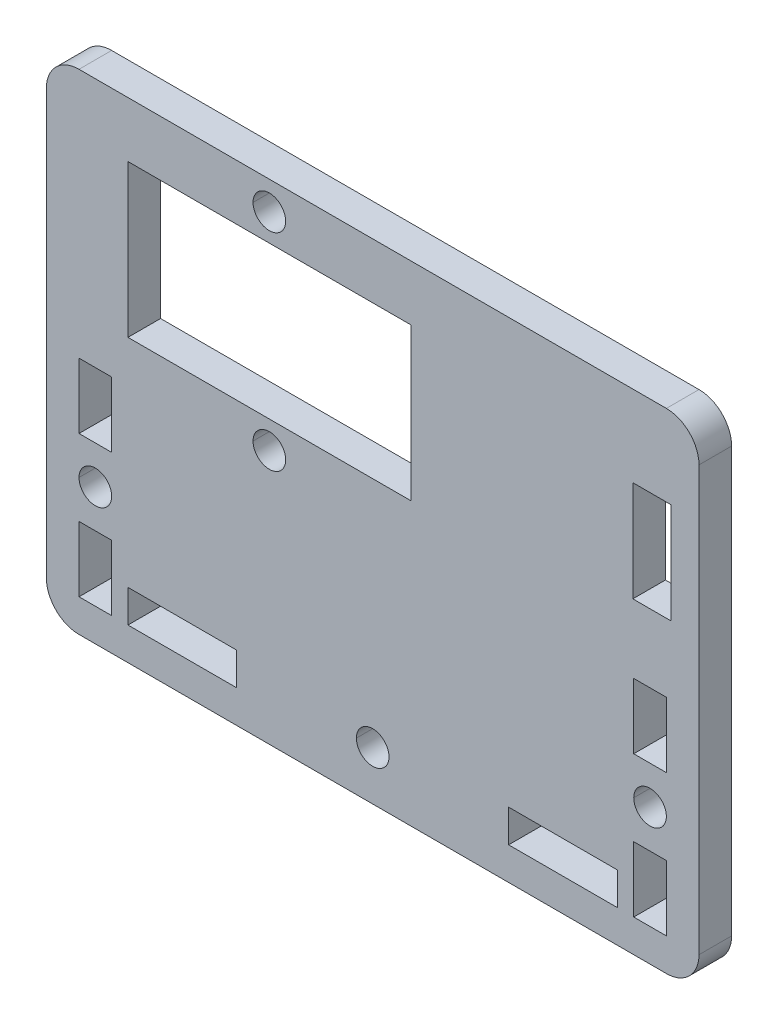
ISO-10303-21;
HEADER;
FILE_DESCRIPTION(('STEP AP214'),'2;1');
FILE_NAME('part.step','',(''),(''),'','','');
FILE_SCHEMA(('AUTOMOTIVE_DESIGN { 1 0 10303 214 1 1 1 1 }'));
ENDSEC;
DATA;
#1=APPLICATION_CONTEXT('core data for automotive mechanical design processes');
#2=APPLICATION_PROTOCOL_DEFINITION('international standard','automotive_design',2000,#1);
#3=PRODUCT_CONTEXT('',#1,'mechanical');
#4=PRODUCT('Part','Part','',(#3));
#5=PRODUCT_RELATED_PRODUCT_CATEGORY('part','',(#4));
#6=PRODUCT_DEFINITION_FORMATION('','',#4);
#7=PRODUCT_DEFINITION_CONTEXT('part definition',#1,'design');
#8=PRODUCT_DEFINITION('design','',#6,#7);
#9=PRODUCT_DEFINITION_SHAPE('','',#8);
#10=(LENGTH_UNIT() NAMED_UNIT(*) SI_UNIT(.MILLI.,.METRE.));
#11=(NAMED_UNIT(*) PLANE_ANGLE_UNIT() SI_UNIT($,.RADIAN.));
#12=(NAMED_UNIT(*) SI_UNIT($,.STERADIAN.) SOLID_ANGLE_UNIT());
#13=UNCERTAINTY_MEASURE_WITH_UNIT(LENGTH_MEASURE(1.E-05),#10,'distance_accuracy_value','');
#14=(GEOMETRIC_REPRESENTATION_CONTEXT(3) GLOBAL_UNCERTAINTY_ASSIGNED_CONTEXT((#13)) GLOBAL_UNIT_ASSIGNED_CONTEXT((#10,
#11,#12)) REPRESENTATION_CONTEXT('',''));
#15=CARTESIAN_POINT('',(0.,0.,0.));
#16=DIRECTION('',(0.,0.,1.));
#17=DIRECTION('',(1.,0.,0.));
#18=AXIS2_PLACEMENT_3D('',#15,#16,#17);
#19=CARTESIAN_POINT('',(164.08029156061,-11.5646735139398,0.));
#20=DIRECTION('',(0.,0.,-1.));
#21=DIRECTION('',(-1.,0.,0.));
#22=AXIS2_PLACEMENT_3D('',#19,#20,#21);
#23=PLANE('',#22);
#24=DIRECTION('',(-1.,0.,0.));
#25=VECTOR('',#24,1.);
#26=CARTESIAN_POINT('',(168.58,25.34,0.));
#27=LINE('',#26,#25);
#28=CARTESIAN_POINT('',(194.58,25.34,0.));
#29=VERTEX_POINT('',#28);
#30=CARTESIAN_POINT('',(168.58,25.34,0.));
#31=VERTEX_POINT('',#30);
#32=EDGE_CURVE('E388',#29,#31,#27,.T.);
#33=ORIENTED_EDGE('',*,*,#32,.T.);
#34=DIRECTION('',(0.,-1.,0.));
#35=VECTOR('',#34,1.);
#36=CARTESIAN_POINT('',(168.58,25.34,0.));
#37=LINE('',#36,#35);
#38=CARTESIAN_POINT('',(168.58,11.34,0.));
#39=VERTEX_POINT('',#38);
#40=EDGE_CURVE('E364',#31,#39,#37,.T.);
#41=ORIENTED_EDGE('',*,*,#40,.T.);
#42=DIRECTION('',(1.,0.,0.));
#43=VECTOR('',#42,1.);
#44=CARTESIAN_POINT('',(168.58,11.34,0.));
#45=LINE('',#44,#43);
#46=CARTESIAN_POINT('',(194.58,11.34,0.));
#47=VERTEX_POINT('',#46);
#48=EDGE_CURVE('E398',#39,#47,#45,.T.);
#49=ORIENTED_EDGE('',*,*,#48,.T.);
#50=DIRECTION('',(0.,1.,0.));
#51=VECTOR('',#50,1.);
#52=CARTESIAN_POINT('',(194.58,25.34,0.));
#53=LINE('',#52,#51);
#54=EDGE_CURVE('E401',#47,#29,#53,.T.);
#55=ORIENTED_EDGE('',*,*,#54,.T.);
#56=EDGE_LOOP('',(#33,#41,#49,#55));
#57=FACE_BOUND('',#56,.T.);
#58=DIRECTION('',(1.,0.,0.));
#59=VECTOR('',#58,1.);
#60=CARTESIAN_POINT('',(164.08029156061,1.43532648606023,0.));
#61=LINE('',#60,#59);
#62=CARTESIAN_POINT('',(167.08029156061,1.43532648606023,0.));
#63=VERTEX_POINT('',#62);
#64=CARTESIAN_POINT('',(164.08029156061,1.43532648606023,0.));
#65=VERTEX_POINT('',#64);
#66=EDGE_CURVE('E519',#63,#65,#61,.F.);
#67=ORIENTED_EDGE('',*,*,#66,.F.);
#68=DIRECTION('',(0.,1.,0.));
#69=VECTOR('',#68,1.);
#70=CARTESIAN_POINT('',(167.08029156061,1.43532648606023,0.));
#71=LINE('',#70,#69);
#72=CARTESIAN_POINT('',(167.08029156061,7.43532648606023,0.));
#73=VERTEX_POINT('',#72);
#74=EDGE_CURVE('E517',#73,#63,#71,.F.);
#75=ORIENTED_EDGE('',*,*,#74,.F.);
#76=DIRECTION('',(1.,0.,0.));
#77=VECTOR('',#76,1.);
#78=CARTESIAN_POINT('',(164.08029156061,7.43532648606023,0.));
#79=LINE('',#78,#77);
#80=CARTESIAN_POINT('',(164.08029156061,7.43532648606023,0.));
#81=VERTEX_POINT('',#80);
#82=EDGE_CURVE('E513',#81,#73,#79,.T.);
#83=ORIENTED_EDGE('',*,*,#82,.F.);
#84=DIRECTION('',(0.,1.,0.));
#85=VECTOR('',#84,1.);
#86=CARTESIAN_POINT('',(164.08029156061,1.43532648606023,0.));
#87=LINE('',#86,#85);
#88=EDGE_CURVE('E509',#65,#81,#87,.T.);
#89=ORIENTED_EDGE('',*,*,#88,.F.);
#90=EDGE_LOOP('',(#67,#75,#83,#89));
#91=FACE_BOUND('',#90,.T.);
#92=CARTESIAN_POINT('',(216.58029156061,-2.06467351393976,0.));
#93=DIRECTION('',(0.,0.,-1.));
#94=DIRECTION('',(-1.,0.,0.));
#95=AXIS2_PLACEMENT_3D('',#92,#93,#94);
#96=CIRCLE('',#95,1.5);
#97=CARTESIAN_POINT('',(215.08029156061,-2.06467351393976,0.));
#98=VERTEX_POINT('',#97);
#99=CARTESIAN_POINT('',(218.08029156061,-2.06467351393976,0.));
#100=VERTEX_POINT('',#99);
#101=EDGE_CURVE('E524',#98,#100,#96,.F.);
#102=ORIENTED_EDGE('',*,*,#101,.T.);
#103=CARTESIAN_POINT('',(216.58029156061,-2.06467351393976,0.));
#104=DIRECTION('',(0.,0.,-1.));
#105=DIRECTION('',(-1.,0.,0.));
#106=AXIS2_PLACEMENT_3D('',#103,#104,#105);
#107=CIRCLE('',#106,1.5);
#108=EDGE_CURVE('E528',#100,#98,#107,.F.);
#109=ORIENTED_EDGE('',*,*,#108,.T.);
#110=EDGE_LOOP('',(#102,#109));
#111=FACE_BOUND('',#110,.T.);
#112=CARTESIAN_POINT('',(181.58029156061,8.83532648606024,0.));
#113=DIRECTION('',(0.,0.,-1.));
#114=DIRECTION('',(-1.,0.,0.));
#115=AXIS2_PLACEMENT_3D('',#112,#113,#114);
#116=CIRCLE('',#115,1.5);
#117=CARTESIAN_POINT('',(180.08029156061,8.83532648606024,0.));
#118=VERTEX_POINT('',#117);
#119=CARTESIAN_POINT('',(183.08029156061,8.83532648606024,0.));
#120=VERTEX_POINT('',#119);
#121=EDGE_CURVE('E532',#118,#120,#116,.F.);
#122=ORIENTED_EDGE('',*,*,#121,.T.);
#123=CARTESIAN_POINT('',(181.58029156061,8.83532648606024,0.));
#124=DIRECTION('',(0.,0.,-1.));
#125=DIRECTION('',(-1.,0.,0.));
#126=AXIS2_PLACEMENT_3D('',#123,#124,#125);
#127=CIRCLE('',#126,1.5);
#128=EDGE_CURVE('E536',#120,#118,#127,.F.);
#129=ORIENTED_EDGE('',*,*,#128,.T.);
#130=EDGE_LOOP('',(#122,#129));
#131=FACE_BOUND('',#130,.T.);
#132=DIRECTION('',(1.,0.,0.));
#133=VECTOR('',#132,1.);
#134=CARTESIAN_POINT('',(213.58029156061,-8.56467351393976,0.));
#135=LINE('',#134,#133);
#136=CARTESIAN_POINT('',(203.58029156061,-8.56467351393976,0.));
#137=VERTEX_POINT('',#136);
#138=CARTESIAN_POINT('',(213.58029156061,-8.56467351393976,0.));
#139=VERTEX_POINT('',#138);
#140=EDGE_CURVE('E552',#137,#139,#135,.T.);
#141=ORIENTED_EDGE('',*,*,#140,.F.);
#142=DIRECTION('',(0.,1.,0.));
#143=VECTOR('',#142,1.);
#144=CARTESIAN_POINT('',(203.58029156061,-11.5646735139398,0.));
#145=LINE('',#144,#143);
#146=CARTESIAN_POINT('',(203.58029156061,-11.5646735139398,0.));
#147=VERTEX_POINT('',#146);
#148=EDGE_CURVE('E550',#147,#137,#145,.T.);
#149=ORIENTED_EDGE('',*,*,#148,.F.);
#150=DIRECTION('',(-1.,0.,0.));
#151=VECTOR('',#150,1.);
#152=CARTESIAN_POINT('',(213.58029156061,-11.5646735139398,0.));
#153=LINE('',#152,#151);
#154=CARTESIAN_POINT('',(213.58029156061,-11.5646735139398,0.));
#155=VERTEX_POINT('',#154);
#156=EDGE_CURVE('E546',#155,#147,#153,.T.);
#157=ORIENTED_EDGE('',*,*,#156,.F.);
#158=DIRECTION('',(0.,1.,0.));
#159=VECTOR('',#158,1.);
#160=CARTESIAN_POINT('',(213.58029156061,-11.5646735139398,0.));
#161=LINE('',#160,#159);
#162=EDGE_CURVE('E542',#139,#155,#161,.F.);
#163=ORIENTED_EDGE('',*,*,#162,.F.);
#164=EDGE_LOOP('',(#141,#149,#157,#163));
#165=FACE_BOUND('',#164,.T.);
#166=DIRECTION('',(1.,0.,0.));
#167=VECTOR('',#166,1.);
#168=CARTESIAN_POINT('',(164.08029156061,-11.5646735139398,0.));
#169=LINE('',#168,#167);
#170=CARTESIAN_POINT('',(167.08029156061,-11.5646735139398,0.));
#171=VERTEX_POINT('',#170);
#172=CARTESIAN_POINT('',(164.08029156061,-11.5646735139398,0.));
#173=VERTEX_POINT('',#172);
#174=EDGE_CURVE('E569',#171,#173,#169,.F.);
#175=ORIENTED_EDGE('',*,*,#174,.F.);
#176=DIRECTION('',(0.,1.,0.));
#177=VECTOR('',#176,1.);
#178=CARTESIAN_POINT('',(167.08029156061,-11.5646735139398,0.));
#179=LINE('',#178,#177);
#180=CARTESIAN_POINT('',(167.08029156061,-5.56467351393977,0.));
#181=VERTEX_POINT('',#180);
#182=EDGE_CURVE('E567',#181,#171,#179,.F.);
#183=ORIENTED_EDGE('',*,*,#182,.F.);
#184=DIRECTION('',(1.,0.,0.));
#185=VECTOR('',#184,1.);
#186=CARTESIAN_POINT('',(164.08029156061,-5.56467351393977,0.));
#187=LINE('',#186,#185);
#188=CARTESIAN_POINT('',(164.08029156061,-5.56467351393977,0.));
#189=VERTEX_POINT('',#188);
#190=EDGE_CURVE('E563',#189,#181,#187,.T.);
#191=ORIENTED_EDGE('',*,*,#190,.F.);
#192=DIRECTION('',(0.,1.,0.));
#193=VECTOR('',#192,1.);
#194=CARTESIAN_POINT('',(164.08029156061,-11.5646735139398,0.));
#195=LINE('',#194,#193);
#196=EDGE_CURVE('E559',#173,#189,#195,.T.);
#197=ORIENTED_EDGE('',*,*,#196,.F.);
#198=EDGE_LOOP('',(#175,#183,#191,#197));
#199=FACE_BOUND('',#198,.T.);
#200=CARTESIAN_POINT('',(218.08029156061,-11.5646735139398,0.));
#201=DIRECTION('',(0.,0.,-1.));
#202=DIRECTION('',(-1.,0.,0.));
#203=AXIS2_PLACEMENT_3D('',#200,#201,#202);
#204=CIRCLE('',#203,3.);
#205=CARTESIAN_POINT('',(218.08029156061,-14.5646735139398,0.));
#206=VERTEX_POINT('',#205);
#207=CARTESIAN_POINT('',(221.08029156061,-11.5646735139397,0.));
#208=VERTEX_POINT('',#207);
#209=EDGE_CURVE('E583',#206,#208,#204,.F.);
#210=ORIENTED_EDGE('',*,*,#209,.F.);
#211=DIRECTION('',(-1.,0.,0.));
#212=VECTOR('',#211,1.);
#213=CARTESIAN_POINT('',(218.08029156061,-14.5646735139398,0.));
#214=LINE('',#213,#212);
#215=CARTESIAN_POINT('',(164.08029156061,-14.5646735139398,0.));
#216=VERTEX_POINT('',#215);
#217=EDGE_CURVE('E580',#206,#216,#214,.T.);
#218=ORIENTED_EDGE('',*,*,#217,.T.);
#219=CARTESIAN_POINT('',(164.08029156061,-11.5646735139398,0.));
#220=DIRECTION('',(0.,0.,-1.));
#221=DIRECTION('',(-1.,0.,0.));
#222=AXIS2_PLACEMENT_3D('',#219,#220,#221);
#223=CIRCLE('',#222,3.);
#224=CARTESIAN_POINT('',(161.08029156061,-11.5646735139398,0.));
#225=VERTEX_POINT('',#224);
#226=EDGE_CURVE('E574',#225,#216,#223,.F.);
#227=ORIENTED_EDGE('',*,*,#226,.F.);
#228=DIRECTION('',(0.,1.,0.));
#229=VECTOR('',#228,1.);
#230=CARTESIAN_POINT('',(161.08029156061,-11.5646735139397,0.));
#231=LINE('',#230,#229);
#232=CARTESIAN_POINT('',(161.08029156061,27.4353264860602,0.));
#233=VERTEX_POINT('',#232);
#234=EDGE_CURVE('E601',#225,#233,#231,.T.);
#235=ORIENTED_EDGE('',*,*,#234,.T.);
#236=CARTESIAN_POINT('',(164.08029156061,27.4353264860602,0.));
#237=DIRECTION('',(0.,0.,-1.));
#238=DIRECTION('',(-1.,0.,0.));
#239=AXIS2_PLACEMENT_3D('',#236,#237,#238);
#240=CIRCLE('',#239,3.);
#241=CARTESIAN_POINT('',(164.08029156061,30.4353264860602,0.));
#242=VERTEX_POINT('',#241);
#243=EDGE_CURVE('E597',#242,#233,#240,.F.);
#244=ORIENTED_EDGE('',*,*,#243,.F.);
#245=DIRECTION('',(1.,0.,0.));
#246=VECTOR('',#245,1.);
#247=CARTESIAN_POINT('',(218.08029156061,30.4353264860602,0.));
#248=LINE('',#247,#246);
#249=CARTESIAN_POINT('',(218.08029156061,30.4353264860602,0.));
#250=VERTEX_POINT('',#249);
#251=EDGE_CURVE('E594',#242,#250,#248,.T.);
#252=ORIENTED_EDGE('',*,*,#251,.T.);
#253=CARTESIAN_POINT('',(218.08029156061,27.4353264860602,0.));
#254=DIRECTION('',(0.,0.,-1.));
#255=DIRECTION('',(-1.,0.,0.));
#256=AXIS2_PLACEMENT_3D('',#253,#254,#255);
#257=CIRCLE('',#256,3.);
#258=CARTESIAN_POINT('',(221.08029156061,27.4353264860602,0.));
#259=VERTEX_POINT('',#258);
#260=EDGE_CURVE('E590',#259,#250,#257,.F.);
#261=ORIENTED_EDGE('',*,*,#260,.F.);
#262=DIRECTION('',(0.,1.,0.));
#263=VECTOR('',#262,1.);
#264=CARTESIAN_POINT('',(221.08029156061,-11.5646735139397,0.));
#265=LINE('',#264,#263);
#266=EDGE_CURVE('E587',#259,#208,#265,.F.);
#267=ORIENTED_EDGE('',*,*,#266,.T.);
#268=EDGE_LOOP('',(#210,#218,#227,#235,#244,#252,#261,#267));
#269=FACE_BOUND('',#268,.T.);
#270=DIRECTION('',(1.,0.,0.));
#271=VECTOR('',#270,1.);
#272=CARTESIAN_POINT('',(218.08029156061,-5.56467351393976,0.));
#273=LINE('',#272,#271);
#274=CARTESIAN_POINT('',(215.08029156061,-5.56467351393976,0.));
#275=VERTEX_POINT('',#274);
#276=CARTESIAN_POINT('',(218.08029156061,-5.56467351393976,0.));
#277=VERTEX_POINT('',#276);
#278=EDGE_CURVE('E614',#275,#277,#273,.T.);
#279=ORIENTED_EDGE('',*,*,#278,.F.);
#280=DIRECTION('',(0.,1.,0.));
#281=VECTOR('',#280,1.);
#282=CARTESIAN_POINT('',(215.08029156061,-11.5646735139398,0.));
#283=LINE('',#282,#281);
#284=CARTESIAN_POINT('',(215.08029156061,-11.5646735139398,0.));
#285=VERTEX_POINT('',#284);
#286=EDGE_CURVE('E612',#285,#275,#283,.T.);
#287=ORIENTED_EDGE('',*,*,#286,.F.);
#288=DIRECTION('',(1.,0.,0.));
#289=VECTOR('',#288,1.);
#290=CARTESIAN_POINT('',(218.08029156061,-11.5646735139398,0.));
#291=LINE('',#290,#289);
#292=CARTESIAN_POINT('',(218.08029156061,-11.5646735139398,0.));
#293=VERTEX_POINT('',#292);
#294=EDGE_CURVE('E608',#293,#285,#291,.F.);
#295=ORIENTED_EDGE('',*,*,#294,.F.);
#296=DIRECTION('',(0.,1.,0.));
#297=VECTOR('',#296,1.);
#298=CARTESIAN_POINT('',(218.08029156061,-11.5646735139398,0.));
#299=LINE('',#298,#297);
#300=EDGE_CURVE('E604',#277,#293,#299,.F.);
#301=ORIENTED_EDGE('',*,*,#300,.F.);
#302=EDGE_LOOP('',(#279,#287,#295,#301));
#303=FACE_BOUND('',#302,.T.);
#304=DIRECTION('',(1.,0.,0.));
#305=VECTOR('',#304,1.);
#306=CARTESIAN_POINT('',(178.58029156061,-8.56467351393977,0.));
#307=LINE('',#306,#305);
#308=CARTESIAN_POINT('',(168.58029156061,-8.56467351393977,0.));
#309=VERTEX_POINT('',#308);
#310=CARTESIAN_POINT('',(178.58029156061,-8.56467351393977,0.));
#311=VERTEX_POINT('',#310);
#312=EDGE_CURVE('E631',#309,#311,#307,.T.);
#313=ORIENTED_EDGE('',*,*,#312,.F.);
#314=DIRECTION('',(0.,1.,0.));
#315=VECTOR('',#314,1.);
#316=CARTESIAN_POINT('',(168.58029156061,-11.5646735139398,0.));
#317=LINE('',#316,#315);
#318=CARTESIAN_POINT('',(168.58029156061,-11.5646735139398,0.));
#319=VERTEX_POINT('',#318);
#320=EDGE_CURVE('E629',#319,#309,#317,.T.);
#321=ORIENTED_EDGE('',*,*,#320,.F.);
#322=DIRECTION('',(-1.,0.,0.));
#323=VECTOR('',#322,1.);
#324=CARTESIAN_POINT('',(178.58029156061,-11.5646735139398,0.));
#325=LINE('',#324,#323);
#326=CARTESIAN_POINT('',(178.58029156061,-11.5646735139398,0.));
#327=VERTEX_POINT('',#326);
#328=EDGE_CURVE('E625',#327,#319,#325,.T.);
#329=ORIENTED_EDGE('',*,*,#328,.F.);
#330=DIRECTION('',(0.,-1.,0.));
#331=VECTOR('',#330,1.);
#332=CARTESIAN_POINT('',(178.58029156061,-11.5646735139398,0.));
#333=LINE('',#332,#331);
#334=EDGE_CURVE('E621',#311,#327,#333,.T.);
#335=ORIENTED_EDGE('',*,*,#334,.F.);
#336=EDGE_LOOP('',(#313,#321,#329,#335));
#337=FACE_BOUND('',#336,.T.);
#338=CARTESIAN_POINT('',(191.08029156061,-10.0646735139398,0.));
#339=DIRECTION('',(0.,0.,-1.));
#340=DIRECTION('',(-1.,0.,0.));
#341=AXIS2_PLACEMENT_3D('',#338,#339,#340);
#342=CIRCLE('',#341,1.5);
#343=CARTESIAN_POINT('',(189.58029156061,-10.0646735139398,0.));
#344=VERTEX_POINT('',#343);
#345=CARTESIAN_POINT('',(192.58029156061,-10.0646735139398,0.));
#346=VERTEX_POINT('',#345);
#347=EDGE_CURVE('E636',#344,#346,#342,.F.);
#348=ORIENTED_EDGE('',*,*,#347,.T.);
#349=CARTESIAN_POINT('',(191.08029156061,-10.0646735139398,0.));
#350=DIRECTION('',(0.,0.,-1.));
#351=DIRECTION('',(-1.,0.,0.));
#352=AXIS2_PLACEMENT_3D('',#349,#350,#351);
#353=CIRCLE('',#352,1.5);
#354=EDGE_CURVE('E640',#346,#344,#353,.F.);
#355=ORIENTED_EDGE('',*,*,#354,.T.);
#356=EDGE_LOOP('',(#348,#355));
#357=FACE_BOUND('',#356,.T.);
#358=CARTESIAN_POINT('',(181.58029156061,27.8353264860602,0.));
#359=DIRECTION('',(0.,0.,-1.));
#360=DIRECTION('',(-1.,0.,0.));
#361=AXIS2_PLACEMENT_3D('',#358,#359,#360);
#362=CIRCLE('',#361,1.5);
#363=CARTESIAN_POINT('',(180.08029156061,27.8353264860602,0.));
#364=VERTEX_POINT('',#363);
#365=CARTESIAN_POINT('',(183.08029156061,27.8353264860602,0.));
#366=VERTEX_POINT('',#365);
#367=EDGE_CURVE('E644',#364,#366,#362,.F.);
#368=ORIENTED_EDGE('',*,*,#367,.T.);
#369=CARTESIAN_POINT('',(181.58029156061,27.8353264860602,0.));
#370=DIRECTION('',(0.,0.,-1.));
#371=DIRECTION('',(-1.,0.,0.));
#372=AXIS2_PLACEMENT_3D('',#369,#370,#371);
#373=CIRCLE('',#372,1.5);
#374=EDGE_CURVE('E648',#366,#364,#373,.F.);
#375=ORIENTED_EDGE('',*,*,#374,.T.);
#376=EDGE_LOOP('',(#368,#375));
#377=FACE_BOUND('',#376,.T.);
#378=CARTESIAN_POINT('',(165.58029156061,-2.06467351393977,0.));
#379=DIRECTION('',(0.,0.,-1.));
#380=DIRECTION('',(-1.,0.,0.));
#381=AXIS2_PLACEMENT_3D('',#378,#379,#380);
#382=CIRCLE('',#381,1.5);
#383=CARTESIAN_POINT('',(164.08029156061,-2.06467351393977,0.));
#384=VERTEX_POINT('',#383);
#385=CARTESIAN_POINT('',(167.08029156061,-2.06467351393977,0.));
#386=VERTEX_POINT('',#385);
#387=EDGE_CURVE('E652',#384,#386,#382,.F.);
#388=ORIENTED_EDGE('',*,*,#387,.T.);
#389=CARTESIAN_POINT('',(165.58029156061,-2.06467351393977,0.));
#390=DIRECTION('',(0.,0.,-1.));
#391=DIRECTION('',(-1.,0.,0.));
#392=AXIS2_PLACEMENT_3D('',#389,#390,#391);
#393=CIRCLE('',#392,1.5);
#394=EDGE_CURVE('E33',#386,#384,#393,.F.);
#395=ORIENTED_EDGE('',*,*,#394,.T.);
#396=EDGE_LOOP('',(#388,#395));
#397=FACE_BOUND('',#396,.T.);
#398=DIRECTION('',(1.,0.,0.));
#399=VECTOR('',#398,1.);
#400=CARTESIAN_POINT('',(215.08029156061,1.43532648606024,0.));
#401=LINE('',#400,#399);
#402=CARTESIAN_POINT('',(218.08029156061,1.43532648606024,0.));
#403=VERTEX_POINT('',#402);
#404=CARTESIAN_POINT('',(215.08029156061,1.43532648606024,0.));
#405=VERTEX_POINT('',#404);
#406=EDGE_CURVE('E414',#403,#405,#401,.F.);
#407=ORIENTED_EDGE('',*,*,#406,.F.);
#408=DIRECTION('',(0.,1.,0.));
#409=VECTOR('',#408,1.);
#410=CARTESIAN_POINT('',(218.08029156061,1.43532648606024,0.));
#411=LINE('',#410,#409);
#412=CARTESIAN_POINT('',(218.08029156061,7.43532648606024,0.));
#413=VERTEX_POINT('',#412);
#414=EDGE_CURVE('E669',#413,#403,#411,.F.);
#415=ORIENTED_EDGE('',*,*,#414,.F.);
#416=DIRECTION('',(1.,0.,0.));
#417=VECTOR('',#416,1.);
#418=CARTESIAN_POINT('',(215.08029156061,7.43532648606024,0.));
#419=LINE('',#418,#417);
#420=CARTESIAN_POINT('',(215.08029156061,7.43532648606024,0.));
#421=VERTEX_POINT('',#420);
#422=EDGE_CURVE('E665',#421,#413,#419,.T.);
#423=ORIENTED_EDGE('',*,*,#422,.F.);
#424=DIRECTION('',(0.,1.,0.));
#425=VECTOR('',#424,1.);
#426=CARTESIAN_POINT('',(215.08029156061,1.43532648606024,0.));
#427=LINE('',#426,#425);
#428=EDGE_CURVE('E661',#405,#421,#427,.T.);
#429=ORIENTED_EDGE('',*,*,#428,.F.);
#430=EDGE_LOOP('',(#407,#415,#423,#429));
#431=FACE_BOUND('',#430,.T.);
#432=DIRECTION('',(-1.,0.,0.));
#433=VECTOR('',#432,1.);
#434=CARTESIAN_POINT('',(214.998040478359,22.9788237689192,0.));
#435=LINE('',#434,#433);
#436=CARTESIAN_POINT('',(218.498040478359,22.9788237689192,0.));
#437=VERTEX_POINT('',#436);
#438=CARTESIAN_POINT('',(214.998040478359,22.9788237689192,0.));
#439=VERTEX_POINT('',#438);
#440=EDGE_CURVE('E357',#437,#439,#435,.T.);
#441=ORIENTED_EDGE('',*,*,#440,.T.);
#442=DIRECTION('',(0.,-1.,0.));
#443=VECTOR('',#442,1.);
#444=CARTESIAN_POINT('',(214.998040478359,13.7288237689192,0.));
#445=LINE('',#444,#443);
#446=CARTESIAN_POINT('',(214.998040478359,13.7288237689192,0.));
#447=VERTEX_POINT('',#446);
#448=EDGE_CURVE('E46',#439,#447,#445,.T.);
#449=ORIENTED_EDGE('',*,*,#448,.T.);
#450=DIRECTION('',(1.,0.,0.));
#451=VECTOR('',#450,1.);
#452=CARTESIAN_POINT('',(214.998040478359,13.7288237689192,0.));
#453=LINE('',#452,#451);
#454=CARTESIAN_POINT('',(218.498040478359,13.7288237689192,0.));
#455=VERTEX_POINT('',#454);
#456=EDGE_CURVE('E363',#447,#455,#453,.T.);
#457=ORIENTED_EDGE('',*,*,#456,.T.);
#458=DIRECTION('',(0.,1.,0.));
#459=VECTOR('',#458,1.);
#460=CARTESIAN_POINT('',(218.498040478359,13.7288237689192,0.));
#461=LINE('',#460,#459);
#462=EDGE_CURVE('E377',#455,#437,#461,.T.);
#463=ORIENTED_EDGE('',*,*,#462,.T.);
#464=EDGE_LOOP('',(#441,#449,#457,#463));
#465=FACE_BOUND('',#464,.T.);
#466=ADVANCED_FACE('F30',(#57,#91,#111,#131,#165,#199,#269,#303,#337,#357,#377,#397,#431,#465),
#23,.T.);
#467=CARTESIAN_POINT('',(164.08029156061,-11.5646735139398,3.));
#468=DIRECTION('',(0.,0.,-1.));
#469=DIRECTION('',(-1.,0.,0.));
#470=AXIS2_PLACEMENT_3D('',#467,#468,#469);
#471=PLANE('',#470);
#472=DIRECTION('',(0.,-1.,0.));
#473=VECTOR('',#472,1.);
#474=CARTESIAN_POINT('',(168.58,25.34,3.));
#475=LINE('',#474,#473);
#476=CARTESIAN_POINT('',(168.58,25.34,3.));
#477=VERTEX_POINT('',#476);
#478=CARTESIAN_POINT('',(168.58,11.34,3.));
#479=VERTEX_POINT('',#478);
#480=EDGE_CURVE('E385',#477,#479,#475,.T.);
#481=ORIENTED_EDGE('',*,*,#480,.F.);
#482=DIRECTION('',(-1.,0.,0.));
#483=VECTOR('',#482,1.);
#484=CARTESIAN_POINT('',(168.58,25.34,3.));
#485=LINE('',#484,#483);
#486=CARTESIAN_POINT('',(194.58,25.34,3.));
#487=VERTEX_POINT('',#486);
#488=EDGE_CURVE('E393',#487,#477,#485,.T.);
#489=ORIENTED_EDGE('',*,*,#488,.F.);
#490=DIRECTION('',(0.,1.,0.));
#491=VECTOR('',#490,1.);
#492=CARTESIAN_POINT('',(194.58,25.34,3.));
#493=LINE('',#492,#491);
#494=CARTESIAN_POINT('',(194.58,11.34,3.));
#495=VERTEX_POINT('',#494);
#496=EDGE_CURVE('E390',#495,#487,#493,.T.);
#497=ORIENTED_EDGE('',*,*,#496,.F.);
#498=DIRECTION('',(1.,0.,0.));
#499=VECTOR('',#498,1.);
#500=CARTESIAN_POINT('',(168.58,11.34,3.));
#501=LINE('',#500,#499);
#502=EDGE_CURVE('E387',#479,#495,#501,.T.);
#503=ORIENTED_EDGE('',*,*,#502,.F.);
#504=EDGE_LOOP('',(#481,#489,#497,#503));
#505=FACE_BOUND('',#504,.T.);
#506=DIRECTION('',(-1.,0.,0.));
#507=VECTOR('',#506,1.);
#508=CARTESIAN_POINT('',(164.08029156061,7.43532648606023,3.));
#509=LINE('',#508,#507);
#510=CARTESIAN_POINT('',(167.08029156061,7.43532648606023,3.));
#511=VERTEX_POINT('',#510);
#512=CARTESIAN_POINT('',(164.08029156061,7.43532648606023,3.));
#513=VERTEX_POINT('',#512);
#514=EDGE_CURVE('E38',#511,#513,#509,.T.);
#515=ORIENTED_EDGE('',*,*,#514,.F.);
#516=DIRECTION('',(0.,1.,0.));
#517=VECTOR('',#516,1.);
#518=CARTESIAN_POINT('',(167.08029156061,-11.5646735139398,3.));
#519=LINE('',#518,#517);
#520=CARTESIAN_POINT('',(167.08029156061,1.43532648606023,3.));
#521=VERTEX_POINT('',#520);
#522=EDGE_CURVE('E418',#521,#511,#519,.T.);
#523=ORIENTED_EDGE('',*,*,#522,.F.);
#524=DIRECTION('',(-1.,0.,0.));
#525=VECTOR('',#524,1.);
#526=CARTESIAN_POINT('',(164.08029156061,1.43532648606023,3.));
#527=LINE('',#526,#525);
#528=CARTESIAN_POINT('',(164.08029156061,1.43532648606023,3.));
#529=VERTEX_POINT('',#528);
#530=EDGE_CURVE('E421',#529,#521,#527,.F.);
#531=ORIENTED_EDGE('',*,*,#530,.F.);
#532=DIRECTION('',(0.,1.,0.));
#533=VECTOR('',#532,1.);
#534=CARTESIAN_POINT('',(164.08029156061,-11.5646735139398,3.));
#535=LINE('',#534,#533);
#536=EDGE_CURVE('E11',#513,#529,#535,.F.);
#537=ORIENTED_EDGE('',*,*,#536,.F.);
#538=EDGE_LOOP('',(#515,#523,#531,#537));
#539=FACE_BOUND('',#538,.T.);
#540=CARTESIAN_POINT('',(216.58029156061,-2.06467351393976,3.));
#541=DIRECTION('',(0.,0.,-1.));
#542=DIRECTION('',(-1.,0.,0.));
#543=AXIS2_PLACEMENT_3D('',#540,#541,#542);
#544=CIRCLE('',#543,1.5);
#545=CARTESIAN_POINT('',(218.08029156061,-2.06467351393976,3.));
#546=VERTEX_POINT('',#545);
#547=CARTESIAN_POINT('',(215.08029156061,-2.06467351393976,3.));
#548=VERTEX_POINT('',#547);
#549=EDGE_CURVE('E682',#546,#548,#544,.F.);
#550=ORIENTED_EDGE('',*,*,#549,.F.);
#551=CARTESIAN_POINT('',(216.58029156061,-2.06467351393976,3.));
#552=DIRECTION('',(0.,0.,-1.));
#553=DIRECTION('',(-1.,0.,0.));
#554=AXIS2_PLACEMENT_3D('',#551,#552,#553);
#555=CIRCLE('',#554,1.5);
#556=EDGE_CURVE('E424',#548,#546,#555,.F.);
#557=ORIENTED_EDGE('',*,*,#556,.F.);
#558=EDGE_LOOP('',(#550,#557));
#559=FACE_BOUND('',#558,.T.);
#560=CARTESIAN_POINT('',(181.58029156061,8.83532648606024,3.));
#561=DIRECTION('',(0.,0.,-1.));
#562=DIRECTION('',(-1.,0.,0.));
#563=AXIS2_PLACEMENT_3D('',#560,#561,#562);
#564=CIRCLE('',#563,1.5);
#565=CARTESIAN_POINT('',(183.08029156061,8.83532648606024,3.));
#566=VERTEX_POINT('',#565);
#567=CARTESIAN_POINT('',(180.08029156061,8.83532648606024,3.));
#568=VERTEX_POINT('',#567);
#569=EDGE_CURVE('E428',#566,#568,#564,.F.);
#570=ORIENTED_EDGE('',*,*,#569,.F.);
#571=CARTESIAN_POINT('',(181.58029156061,8.83532648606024,3.));
#572=DIRECTION('',(0.,0.,-1.));
#573=DIRECTION('',(-1.,0.,0.));
#574=AXIS2_PLACEMENT_3D('',#571,#572,#573);
#575=CIRCLE('',#574,1.5);
#576=EDGE_CURVE('E685',#568,#566,#575,.F.);
#577=ORIENTED_EDGE('',*,*,#576,.F.);
#578=EDGE_LOOP('',(#570,#577));
#579=FACE_BOUND('',#578,.T.);
#580=DIRECTION('',(-1.,0.,0.));
#581=VECTOR('',#580,1.);
#582=CARTESIAN_POINT('',(164.08029156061,-11.5646735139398,3.));
#583=LINE('',#582,#581);
#584=CARTESIAN_POINT('',(203.58029156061,-11.5646735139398,3.));
#585=VERTEX_POINT('',#584);
#586=CARTESIAN_POINT('',(213.58029156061,-11.5646735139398,3.));
#587=VERTEX_POINT('',#586);
#588=EDGE_CURVE('E429',#585,#587,#583,.F.);
#589=ORIENTED_EDGE('',*,*,#588,.F.);
#590=DIRECTION('',(0.,1.,0.));
#591=VECTOR('',#590,1.);
#592=CARTESIAN_POINT('',(203.58029156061,-11.5646735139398,3.));
#593=LINE('',#592,#591);
#594=CARTESIAN_POINT('',(203.58029156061,-8.56467351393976,3.));
#595=VERTEX_POINT('',#594);
#596=EDGE_CURVE('E432',#595,#585,#593,.F.);
#597=ORIENTED_EDGE('',*,*,#596,.F.);
#598=DIRECTION('',(-1.,0.,0.));
#599=VECTOR('',#598,1.);
#600=CARTESIAN_POINT('',(164.08029156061,-8.56467351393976,3.));
#601=LINE('',#600,#599);
#602=CARTESIAN_POINT('',(213.58029156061,-8.56467351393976,3.));
#603=VERTEX_POINT('',#602);
#604=EDGE_CURVE('E435',#603,#595,#601,.T.);
#605=ORIENTED_EDGE('',*,*,#604,.F.);
#606=DIRECTION('',(0.,1.,0.));
#607=VECTOR('',#606,1.);
#608=CARTESIAN_POINT('',(213.58029156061,-11.5646735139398,3.));
#609=LINE('',#608,#607);
#610=EDGE_CURVE('E425',#587,#603,#609,.T.);
#611=ORIENTED_EDGE('',*,*,#610,.F.);
#612=EDGE_LOOP('',(#589,#597,#605,#611));
#613=FACE_BOUND('',#612,.T.);
#614=DIRECTION('',(-1.,0.,0.));
#615=VECTOR('',#614,1.);
#616=CARTESIAN_POINT('',(164.08029156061,-5.56467351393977,3.));
#617=LINE('',#616,#615);
#618=CARTESIAN_POINT('',(167.08029156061,-5.56467351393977,3.));
#619=VERTEX_POINT('',#618);
#620=CARTESIAN_POINT('',(164.08029156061,-5.56467351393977,3.));
#621=VERTEX_POINT('',#620);
#622=EDGE_CURVE('E441',#619,#621,#617,.T.);
#623=ORIENTED_EDGE('',*,*,#622,.F.);
#624=DIRECTION('',(0.,1.,0.));
#625=VECTOR('',#624,1.);
#626=CARTESIAN_POINT('',(167.08029156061,-11.5646735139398,3.));
#627=LINE('',#626,#625);
#628=CARTESIAN_POINT('',(167.08029156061,-11.5646735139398,3.));
#629=VERTEX_POINT('',#628);
#630=EDGE_CURVE('E444',#629,#619,#627,.T.);
#631=ORIENTED_EDGE('',*,*,#630,.F.);
#632=DIRECTION('',(-1.,0.,0.));
#633=VECTOR('',#632,1.);
#634=CARTESIAN_POINT('',(164.08029156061,-11.5646735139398,3.));
#635=LINE('',#634,#633);
#636=CARTESIAN_POINT('',(164.08029156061,-11.5646735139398,3.));
#637=VERTEX_POINT('',#636);
#638=EDGE_CURVE('E447',#637,#629,#635,.F.);
#639=ORIENTED_EDGE('',*,*,#638,.F.);
#640=DIRECTION('',(0.,1.,0.));
#641=VECTOR('',#640,1.);
#642=CARTESIAN_POINT('',(164.08029156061,-11.5646735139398,3.));
#643=LINE('',#642,#641);
#644=EDGE_CURVE('E438',#621,#637,#643,.F.);
#645=ORIENTED_EDGE('',*,*,#644,.F.);
#646=EDGE_LOOP('',(#623,#631,#639,#645));
#647=FACE_BOUND('',#646,.T.);
#648=DIRECTION('',(-1.,0.,0.));
#649=VECTOR('',#648,1.);
#650=CARTESIAN_POINT('',(164.08029156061,-14.5646735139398,3.));
#651=LINE('',#650,#649);
#652=CARTESIAN_POINT('',(218.08029156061,-14.5646735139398,3.));
#653=VERTEX_POINT('',#652);
#654=CARTESIAN_POINT('',(164.08029156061,-14.5646735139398,3.));
#655=VERTEX_POINT('',#654);
#656=EDGE_CURVE('E451',#653,#655,#651,.T.);
#657=ORIENTED_EDGE('',*,*,#656,.F.);
#658=CARTESIAN_POINT('',(218.08029156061,-11.5646735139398,3.));
#659=DIRECTION('',(0.,0.,-1.));
#660=DIRECTION('',(-1.,0.,0.));
#661=AXIS2_PLACEMENT_3D('',#658,#659,#660);
#662=CIRCLE('',#661,3.);
#663=CARTESIAN_POINT('',(221.08029156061,-11.5646735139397,3.));
#664=VERTEX_POINT('',#663);
#665=EDGE_CURVE('E454',#664,#653,#662,.T.);
#666=ORIENTED_EDGE('',*,*,#665,.F.);
#667=DIRECTION('',(0.,1.,0.));
#668=VECTOR('',#667,1.);
#669=CARTESIAN_POINT('',(221.08029156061,-11.5646735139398,3.));
#670=LINE('',#669,#668);
#671=CARTESIAN_POINT('',(221.08029156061,27.4353264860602,3.));
#672=VERTEX_POINT('',#671);
#673=EDGE_CURVE('E455',#672,#664,#670,.F.);
#674=ORIENTED_EDGE('',*,*,#673,.F.);
#675=CARTESIAN_POINT('',(218.08029156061,27.4353264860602,3.));
#676=DIRECTION('',(0.,0.,-1.));
#677=DIRECTION('',(-1.,0.,0.));
#678=AXIS2_PLACEMENT_3D('',#675,#676,#677);
#679=CIRCLE('',#678,3.);
#680=CARTESIAN_POINT('',(218.08029156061,30.4353264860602,3.));
#681=VERTEX_POINT('',#680);
#682=EDGE_CURVE('E458',#681,#672,#679,.T.);
#683=ORIENTED_EDGE('',*,*,#682,.F.);
#684=DIRECTION('',(-1.,0.,0.));
#685=VECTOR('',#684,1.);
#686=CARTESIAN_POINT('',(164.08029156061,30.4353264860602,3.));
#687=LINE('',#686,#685);
#688=CARTESIAN_POINT('',(164.08029156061,30.4353264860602,3.));
#689=VERTEX_POINT('',#688);
#690=EDGE_CURVE('E459',#689,#681,#687,.F.);
#691=ORIENTED_EDGE('',*,*,#690,.F.);
#692=CARTESIAN_POINT('',(164.08029156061,27.4353264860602,3.));
#693=DIRECTION('',(0.,0.,-1.));
#694=DIRECTION('',(-1.,0.,0.));
#695=AXIS2_PLACEMENT_3D('',#692,#693,#694);
#696=CIRCLE('',#695,3.);
#697=CARTESIAN_POINT('',(161.08029156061,27.4353264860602,3.));
#698=VERTEX_POINT('',#697);
#699=EDGE_CURVE('E462',#698,#689,#696,.T.);
#700=ORIENTED_EDGE('',*,*,#699,.F.);
#701=DIRECTION('',(0.,1.,0.));
#702=VECTOR('',#701,1.);
#703=CARTESIAN_POINT('',(161.08029156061,-11.5646735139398,3.));
#704=LINE('',#703,#702);
#705=CARTESIAN_POINT('',(161.08029156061,-11.5646735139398,3.));
#706=VERTEX_POINT('',#705);
#707=EDGE_CURVE('E463',#706,#698,#704,.T.);
#708=ORIENTED_EDGE('',*,*,#707,.F.);
#709=CARTESIAN_POINT('',(164.08029156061,-11.5646735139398,3.));
#710=DIRECTION('',(0.,0.,-1.));
#711=DIRECTION('',(-1.,0.,0.));
#712=AXIS2_PLACEMENT_3D('',#709,#710,#711);
#713=CIRCLE('',#712,3.);
#714=EDGE_CURVE('E450',#655,#706,#713,.T.);
#715=ORIENTED_EDGE('',*,*,#714,.F.);
#716=EDGE_LOOP('',(#657,#666,#674,#683,#691,#700,#708,#715));
#717=FACE_BOUND('',#716,.T.);
#718=DIRECTION('',(-1.,0.,0.));
#719=VECTOR('',#718,1.);
#720=CARTESIAN_POINT('',(164.08029156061,-11.5646735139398,3.));
#721=LINE('',#720,#719);
#722=CARTESIAN_POINT('',(215.08029156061,-11.5646735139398,3.));
#723=VERTEX_POINT('',#722);
#724=CARTESIAN_POINT('',(218.08029156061,-11.5646735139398,3.));
#725=VERTEX_POINT('',#724);
#726=EDGE_CURVE('E469',#723,#725,#721,.F.);
#727=ORIENTED_EDGE('',*,*,#726,.F.);
#728=DIRECTION('',(0.,1.,0.));
#729=VECTOR('',#728,1.);
#730=CARTESIAN_POINT('',(215.08029156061,-11.5646735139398,3.));
#731=LINE('',#730,#729);
#732=CARTESIAN_POINT('',(215.08029156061,-5.56467351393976,3.));
#733=VERTEX_POINT('',#732);
#734=EDGE_CURVE('E472',#733,#723,#731,.F.);
#735=ORIENTED_EDGE('',*,*,#734,.F.);
#736=DIRECTION('',(-1.,0.,0.));
#737=VECTOR('',#736,1.);
#738=CARTESIAN_POINT('',(164.08029156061,-5.56467351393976,3.));
#739=LINE('',#738,#737);
#740=CARTESIAN_POINT('',(218.08029156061,-5.56467351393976,3.));
#741=VERTEX_POINT('',#740);
#742=EDGE_CURVE('E475',#741,#733,#739,.T.);
#743=ORIENTED_EDGE('',*,*,#742,.F.);
#744=DIRECTION('',(0.,1.,0.));
#745=VECTOR('',#744,1.);
#746=CARTESIAN_POINT('',(218.08029156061,-11.5646735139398,3.));
#747=LINE('',#746,#745);
#748=EDGE_CURVE('E466',#725,#741,#747,.T.);
#749=ORIENTED_EDGE('',*,*,#748,.F.);
#750=EDGE_LOOP('',(#727,#735,#743,#749));
#751=FACE_BOUND('',#750,.T.);
#752=DIRECTION('',(-1.,0.,0.));
#753=VECTOR('',#752,1.);
#754=CARTESIAN_POINT('',(164.08029156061,-11.5646735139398,3.));
#755=LINE('',#754,#753);
#756=CARTESIAN_POINT('',(168.58029156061,-11.5646735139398,3.));
#757=VERTEX_POINT('',#756);
#758=CARTESIAN_POINT('',(178.58029156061,-11.5646735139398,3.));
#759=VERTEX_POINT('',#758);
#760=EDGE_CURVE('E481',#757,#759,#755,.F.);
#761=ORIENTED_EDGE('',*,*,#760,.F.);
#762=DIRECTION('',(0.,1.,0.));
#763=VECTOR('',#762,1.);
#764=CARTESIAN_POINT('',(168.58029156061,-11.5646735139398,3.));
#765=LINE('',#764,#763);
#766=CARTESIAN_POINT('',(168.58029156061,-8.56467351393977,3.));
#767=VERTEX_POINT('',#766);
#768=EDGE_CURVE('E484',#767,#757,#765,.F.);
#769=ORIENTED_EDGE('',*,*,#768,.F.);
#770=DIRECTION('',(-1.,0.,0.));
#771=VECTOR('',#770,1.);
#772=CARTESIAN_POINT('',(164.08029156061,-8.56467351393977,3.));
#773=LINE('',#772,#771);
#774=CARTESIAN_POINT('',(178.58029156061,-8.56467351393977,3.));
#775=VERTEX_POINT('',#774);
#776=EDGE_CURVE('E487',#775,#767,#773,.T.);
#777=ORIENTED_EDGE('',*,*,#776,.F.);
#778=DIRECTION('',(0.,1.,0.));
#779=VECTOR('',#778,1.);
#780=CARTESIAN_POINT('',(178.58029156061,-11.5646735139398,3.));
#781=LINE('',#780,#779);
#782=EDGE_CURVE('E478',#759,#775,#781,.T.);
#783=ORIENTED_EDGE('',*,*,#782,.F.);
#784=EDGE_LOOP('',(#761,#769,#777,#783));
#785=FACE_BOUND('',#784,.T.);
#786=CARTESIAN_POINT('',(191.08029156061,-10.0646735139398,3.));
#787=DIRECTION('',(0.,0.,-1.));
#788=DIRECTION('',(-1.,0.,0.));
#789=AXIS2_PLACEMENT_3D('',#786,#787,#788);
#790=CIRCLE('',#789,1.5);
#791=CARTESIAN_POINT('',(192.58029156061,-10.0646735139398,3.));
#792=VERTEX_POINT('',#791);
#793=CARTESIAN_POINT('',(189.58029156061,-10.0646735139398,3.));
#794=VERTEX_POINT('',#793);
#795=EDGE_CURVE('E700',#792,#794,#790,.F.);
#796=ORIENTED_EDGE('',*,*,#795,.F.);
#797=CARTESIAN_POINT('',(191.08029156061,-10.0646735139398,3.));
#798=DIRECTION('',(0.,0.,-1.));
#799=DIRECTION('',(-1.,0.,0.));
#800=AXIS2_PLACEMENT_3D('',#797,#798,#799);
#801=CIRCLE('',#800,1.5);
#802=EDGE_CURVE('E490',#794,#792,#801,.F.);
#803=ORIENTED_EDGE('',*,*,#802,.F.);
#804=EDGE_LOOP('',(#796,#803));
#805=FACE_BOUND('',#804,.T.);
#806=CARTESIAN_POINT('',(181.58029156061,27.8353264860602,3.));
#807=DIRECTION('',(0.,0.,-1.));
#808=DIRECTION('',(-1.,0.,0.));
#809=AXIS2_PLACEMENT_3D('',#806,#807,#808);
#810=CIRCLE('',#809,1.5);
#811=CARTESIAN_POINT('',(183.08029156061,27.8353264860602,3.));
#812=VERTEX_POINT('',#811);
#813=CARTESIAN_POINT('',(180.08029156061,27.8353264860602,3.));
#814=VERTEX_POINT('',#813);
#815=EDGE_CURVE('E706',#812,#814,#810,.F.);
#816=ORIENTED_EDGE('',*,*,#815,.F.);
#817=CARTESIAN_POINT('',(181.58029156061,27.8353264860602,3.));
#818=DIRECTION('',(0.,0.,-1.));
#819=DIRECTION('',(-1.,0.,0.));
#820=AXIS2_PLACEMENT_3D('',#817,#818,#819);
#821=CIRCLE('',#820,1.5);
#822=EDGE_CURVE('E703',#814,#812,#821,.F.);
#823=ORIENTED_EDGE('',*,*,#822,.F.);
#824=EDGE_LOOP('',(#816,#823));
#825=FACE_BOUND('',#824,.T.);
#826=CARTESIAN_POINT('',(165.58029156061,-2.06467351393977,3.));
#827=DIRECTION('',(0.,0.,-1.));
#828=DIRECTION('',(-1.,0.,0.));
#829=AXIS2_PLACEMENT_3D('',#826,#827,#828);
#830=CIRCLE('',#829,1.5);
#831=CARTESIAN_POINT('',(167.08029156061,-2.06467351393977,3.));
#832=VERTEX_POINT('',#831);
#833=CARTESIAN_POINT('',(164.08029156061,-2.06467351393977,3.));
#834=VERTEX_POINT('',#833);
#835=EDGE_CURVE('E494',#832,#834,#830,.F.);
#836=ORIENTED_EDGE('',*,*,#835,.F.);
#837=CARTESIAN_POINT('',(165.58029156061,-2.06467351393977,3.));
#838=DIRECTION('',(0.,0.,-1.));
#839=DIRECTION('',(-1.,0.,0.));
#840=AXIS2_PLACEMENT_3D('',#837,#838,#839);
#841=CIRCLE('',#840,1.5);
#842=EDGE_CURVE('E709',#834,#832,#841,.F.);
#843=ORIENTED_EDGE('',*,*,#842,.F.);
#844=EDGE_LOOP('',(#836,#843));
#845=FACE_BOUND('',#844,.T.);
#846=DIRECTION('',(-1.,0.,0.));
#847=VECTOR('',#846,1.);
#848=CARTESIAN_POINT('',(164.08029156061,7.43532648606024,3.));
#849=LINE('',#848,#847);
#850=CARTESIAN_POINT('',(218.08029156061,7.43532648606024,3.));
#851=VERTEX_POINT('',#850);
#852=CARTESIAN_POINT('',(215.08029156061,7.43532648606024,3.));
#853=VERTEX_POINT('',#852);
#854=EDGE_CURVE('E495',#851,#853,#849,.T.);
#855=ORIENTED_EDGE('',*,*,#854,.F.);
#856=DIRECTION('',(0.,1.,0.));
#857=VECTOR('',#856,1.);
#858=CARTESIAN_POINT('',(218.08029156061,-11.5646735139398,3.));
#859=LINE('',#858,#857);
#860=CARTESIAN_POINT('',(218.08029156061,1.43532648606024,3.));
#861=VERTEX_POINT('',#860);
#862=EDGE_CURVE('E498',#861,#851,#859,.T.);
#863=ORIENTED_EDGE('',*,*,#862,.F.);
#864=DIRECTION('',(-1.,0.,0.));
#865=VECTOR('',#864,1.);
#866=CARTESIAN_POINT('',(164.08029156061,1.43532648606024,3.));
#867=LINE('',#866,#865);
#868=CARTESIAN_POINT('',(215.08029156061,1.43532648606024,3.));
#869=VERTEX_POINT('',#868);
#870=EDGE_CURVE('E501',#869,#861,#867,.F.);
#871=ORIENTED_EDGE('',*,*,#870,.F.);
#872=DIRECTION('',(0.,1.,0.));
#873=VECTOR('',#872,1.);
#874=CARTESIAN_POINT('',(215.08029156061,-11.5646735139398,3.));
#875=LINE('',#874,#873);
#876=EDGE_CURVE('E491',#853,#869,#875,.F.);
#877=ORIENTED_EDGE('',*,*,#876,.F.);
#878=EDGE_LOOP('',(#855,#863,#871,#877));
#879=FACE_BOUND('',#878,.T.);
#880=DIRECTION('',(0.,-1.,0.));
#881=VECTOR('',#880,1.);
#882=CARTESIAN_POINT('',(214.998040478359,13.7288237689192,3.));
#883=LINE('',#882,#881);
#884=CARTESIAN_POINT('',(214.998040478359,22.9788237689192,3.));
#885=VERTEX_POINT('',#884);
#886=CARTESIAN_POINT('',(214.998040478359,13.7288237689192,3.));
#887=VERTEX_POINT('',#886);
#888=EDGE_CURVE('E348',#885,#887,#883,.T.);
#889=ORIENTED_EDGE('',*,*,#888,.F.);
#890=DIRECTION('',(-1.,0.,0.));
#891=VECTOR('',#890,1.);
#892=CARTESIAN_POINT('',(214.998040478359,22.9788237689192,3.));
#893=LINE('',#892,#891);
#894=CARTESIAN_POINT('',(218.498040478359,22.9788237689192,3.));
#895=VERTEX_POINT('',#894);
#896=EDGE_CURVE('E371',#895,#885,#893,.T.);
#897=ORIENTED_EDGE('',*,*,#896,.F.);
#898=DIRECTION('',(0.,1.,0.));
#899=VECTOR('',#898,1.);
#900=CARTESIAN_POINT('',(218.498040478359,13.7288237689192,3.));
#901=LINE('',#900,#899);
#902=CARTESIAN_POINT('',(218.498040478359,13.7288237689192,3.));
#903=VERTEX_POINT('',#902);
#904=EDGE_CURVE('E369',#903,#895,#901,.T.);
#905=ORIENTED_EDGE('',*,*,#904,.F.);
#906=DIRECTION('',(1.,0.,0.));
#907=VECTOR('',#906,1.);
#908=CARTESIAN_POINT('',(214.998040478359,13.7288237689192,3.));
#909=LINE('',#908,#907);
#910=EDGE_CURVE('E356',#887,#903,#909,.T.);
#911=ORIENTED_EDGE('',*,*,#910,.F.);
#912=EDGE_LOOP('',(#889,#897,#905,#911));
#913=FACE_BOUND('',#912,.T.);
#914=ADVANCED_FACE('F368',(#505,#539,#559,#579,#613,#647,#717,#751,#785,#805,#825,#845,#879,
#913),#471,.F.);
#915=CARTESIAN_POINT('',(215.08029156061,1.43532648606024,3.));
#916=DIRECTION('',(0.,1.,0.));
#917=DIRECTION('',(0.,0.,1.));
#918=AXIS2_PLACEMENT_3D('',#915,#916,#917);
#919=PLANE('',#918);
#920=ORIENTED_EDGE('',*,*,#870,.T.);
#921=DIRECTION('',(0.,0.,1.));
#922=VECTOR('',#921,1.);
#923=CARTESIAN_POINT('',(218.08029156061,1.43532648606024,3.));
#924=LINE('',#923,#922);
#925=EDGE_CURVE('E667',#403,#861,#924,.T.);
#926=ORIENTED_EDGE('',*,*,#925,.F.);
#927=ORIENTED_EDGE('',*,*,#406,.T.);
#928=DIRECTION('',(0.,0.,-1.));
#929=VECTOR('',#928,1.);
#930=CARTESIAN_POINT('',(215.08029156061,1.43532648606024,3.));
#931=LINE('',#930,#929);
#932=EDGE_CURVE('E656',#869,#405,#931,.T.);
#933=ORIENTED_EDGE('',*,*,#932,.F.);
#934=EDGE_LOOP('',(#920,#926,#927,#933));
#935=FACE_BOUND('',#934,.T.);
#936=ADVANCED_FACE('F742',(#935),#919,.T.);
#937=CARTESIAN_POINT('',(218.08029156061,1.43532648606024,3.));
#938=DIRECTION('',(-1.,0.,0.));
#939=DIRECTION('',(0.,0.,1.));
#940=AXIS2_PLACEMENT_3D('',#937,#938,#939);
#941=PLANE('',#940);
#942=ORIENTED_EDGE('',*,*,#862,.T.);
#943=DIRECTION('',(0.,0.,-1.));
#944=VECTOR('',#943,1.);
#945=CARTESIAN_POINT('',(218.08029156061,7.43532648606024,3.));
#946=LINE('',#945,#944);
#947=EDGE_CURVE('E663',#413,#851,#946,.F.);
#948=ORIENTED_EDGE('',*,*,#947,.F.);
#949=ORIENTED_EDGE('',*,*,#414,.T.);
#950=ORIENTED_EDGE('',*,*,#925,.T.);
#951=EDGE_LOOP('',(#942,#948,#949,#950));
#952=FACE_BOUND('',#951,.T.);
#953=ADVANCED_FACE('F753',(#952),#941,.T.);
#954=CARTESIAN_POINT('',(215.08029156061,7.43532648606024,3.));
#955=DIRECTION('',(0.,-1.,0.));
#956=DIRECTION('',(0.,0.,-1.));
#957=AXIS2_PLACEMENT_3D('',#954,#955,#956);
#958=PLANE('',#957);
#959=ORIENTED_EDGE('',*,*,#854,.T.);
#960=DIRECTION('',(0.,0.,-1.));
#961=VECTOR('',#960,1.);
#962=CARTESIAN_POINT('',(215.08029156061,7.43532648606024,3.));
#963=LINE('',#962,#961);
#964=EDGE_CURVE('E659',#421,#853,#963,.F.);
#965=ORIENTED_EDGE('',*,*,#964,.F.);
#966=ORIENTED_EDGE('',*,*,#422,.T.);
#967=ORIENTED_EDGE('',*,*,#947,.T.);
#968=EDGE_LOOP('',(#959,#965,#966,#967));
#969=FACE_BOUND('',#968,.T.);
#970=ADVANCED_FACE('F763',(#969),#958,.T.);
#971=CARTESIAN_POINT('',(215.08029156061,1.43532648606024,3.));
#972=DIRECTION('',(1.,0.,0.));
#973=DIRECTION('',(0.,0.,-1.));
#974=AXIS2_PLACEMENT_3D('',#971,#972,#973);
#975=PLANE('',#974);
#976=ORIENTED_EDGE('',*,*,#876,.T.);
#977=ORIENTED_EDGE('',*,*,#932,.T.);
#978=ORIENTED_EDGE('',*,*,#428,.T.);
#979=ORIENTED_EDGE('',*,*,#964,.T.);
#980=EDGE_LOOP('',(#976,#977,#978,#979));
#981=FACE_BOUND('',#980,.T.);
#982=ADVANCED_FACE('F761',(#981),#975,.T.);
#983=CARTESIAN_POINT('',(165.58029156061,-2.06467351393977,3.));
#984=DIRECTION('',(0.,0.,-1.));
#985=DIRECTION('',(-1.,0.,0.));
#986=AXIS2_PLACEMENT_3D('',#983,#984,#985);
#987=CYLINDRICAL_SURFACE('',#986,1.5);
#988=ORIENTED_EDGE('',*,*,#835,.T.);
#989=DIRECTION('',(0.,0.,-1.));
#990=VECTOR('',#989,1.);
#991=CARTESIAN_POINT('',(164.08029156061,-2.06467351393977,3.));
#992=LINE('',#991,#990);
#993=EDGE_CURVE('E653',#834,#384,#992,.T.);
#994=ORIENTED_EDGE('',*,*,#993,.T.);
#995=ORIENTED_EDGE('',*,*,#394,.F.);
#996=DIRECTION('',(0.,0.,-1.));
#997=VECTOR('',#996,1.);
#998=CARTESIAN_POINT('',(167.08029156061,-2.06467351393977,3.));
#999=LINE('',#998,#997);
#1000=EDGE_CURVE('E649',#386,#832,#999,.F.);
#1001=ORIENTED_EDGE('',*,*,#1000,.T.);
#1002=EDGE_LOOP('',(#988,#994,#995,#1001));
#1003=FACE_BOUND('',#1002,.T.);
#1004=ADVANCED_FACE('F738',(#1003),#987,.F.);
#1005=CARTESIAN_POINT('',(165.58029156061,-2.06467351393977,3.));
#1006=DIRECTION('',(0.,0.,-1.));
#1007=DIRECTION('',(-1.,0.,0.));
#1008=AXIS2_PLACEMENT_3D('',#1005,#1006,#1007);
#1009=CYLINDRICAL_SURFACE('',#1008,1.5);
#1010=ORIENTED_EDGE('',*,*,#1000,.F.);
#1011=ORIENTED_EDGE('',*,*,#387,.F.);
#1012=ORIENTED_EDGE('',*,*,#993,.F.);
#1013=ORIENTED_EDGE('',*,*,#842,.T.);
#1014=EDGE_LOOP('',(#1010,#1011,#1012,#1013));
#1015=FACE_BOUND('',#1014,.T.);
#1016=ADVANCED_FACE('F735',(#1015),#1009,.F.);
#1017=CARTESIAN_POINT('',(181.58029156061,27.8353264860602,3.));
#1018=DIRECTION('',(0.,0.,-1.));
#1019=DIRECTION('',(-1.,0.,0.));
#1020=AXIS2_PLACEMENT_3D('',#1017,#1018,#1019);
#1021=CYLINDRICAL_SURFACE('',#1020,1.5);
#1022=ORIENTED_EDGE('',*,*,#815,.T.);
#1023=DIRECTION('',(0.,0.,-1.));
#1024=VECTOR('',#1023,1.);
#1025=CARTESIAN_POINT('',(180.08029156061,27.8353264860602,3.));
#1026=LINE('',#1025,#1024);
#1027=EDGE_CURVE('E645',#814,#364,#1026,.T.);
#1028=ORIENTED_EDGE('',*,*,#1027,.T.);
#1029=ORIENTED_EDGE('',*,*,#374,.F.);
#1030=DIRECTION('',(0.,0.,-1.));
#1031=VECTOR('',#1030,1.);
#1032=CARTESIAN_POINT('',(183.08029156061,27.8353264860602,3.));
#1033=LINE('',#1032,#1031);
#1034=EDGE_CURVE('E641',#366,#812,#1033,.F.);
#1035=ORIENTED_EDGE('',*,*,#1034,.T.);
#1036=EDGE_LOOP('',(#1022,#1028,#1029,#1035));
#1037=FACE_BOUND('',#1036,.T.);
#1038=ADVANCED_FACE('F936',(#1037),#1021,.F.);
#1039=CARTESIAN_POINT('',(181.58029156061,27.8353264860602,3.));
#1040=DIRECTION('',(0.,0.,-1.));
#1041=DIRECTION('',(-1.,0.,0.));
#1042=AXIS2_PLACEMENT_3D('',#1039,#1040,#1041);
#1043=CYLINDRICAL_SURFACE('',#1042,1.5);
#1044=ORIENTED_EDGE('',*,*,#1034,.F.);
#1045=ORIENTED_EDGE('',*,*,#367,.F.);
#1046=ORIENTED_EDGE('',*,*,#1027,.F.);
#1047=ORIENTED_EDGE('',*,*,#822,.T.);
#1048=EDGE_LOOP('',(#1044,#1045,#1046,#1047));
#1049=FACE_BOUND('',#1048,.T.);
#1050=ADVANCED_FACE('F932',(#1049),#1043,.F.);
#1051=CARTESIAN_POINT('',(191.08029156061,-10.0646735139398,3.));
#1052=DIRECTION('',(0.,0.,-1.));
#1053=DIRECTION('',(-1.,0.,0.));
#1054=AXIS2_PLACEMENT_3D('',#1051,#1052,#1053);
#1055=CYLINDRICAL_SURFACE('',#1054,1.5);
#1056=ORIENTED_EDGE('',*,*,#795,.T.);
#1057=DIRECTION('',(0.,0.,-1.));
#1058=VECTOR('',#1057,1.);
#1059=CARTESIAN_POINT('',(189.58029156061,-10.0646735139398,3.));
#1060=LINE('',#1059,#1058);
#1061=EDGE_CURVE('E637',#794,#344,#1060,.T.);
#1062=ORIENTED_EDGE('',*,*,#1061,.T.);
#1063=ORIENTED_EDGE('',*,*,#354,.F.);
#1064=DIRECTION('',(0.,0.,-1.));
#1065=VECTOR('',#1064,1.);
#1066=CARTESIAN_POINT('',(192.58029156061,-10.0646735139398,3.));
#1067=LINE('',#1066,#1065);
#1068=EDGE_CURVE('E633',#346,#792,#1067,.F.);
#1069=ORIENTED_EDGE('',*,*,#1068,.T.);
#1070=EDGE_LOOP('',(#1056,#1062,#1063,#1069));
#1071=FACE_BOUND('',#1070,.T.);
#1072=ADVANCED_FACE('F928',(#1071),#1055,.F.);
#1073=CARTESIAN_POINT('',(191.08029156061,-10.0646735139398,3.));
#1074=DIRECTION('',(0.,0.,-1.));
#1075=DIRECTION('',(-1.,0.,0.));
#1076=AXIS2_PLACEMENT_3D('',#1073,#1074,#1075);
#1077=CYLINDRICAL_SURFACE('',#1076,1.5);
#1078=ORIENTED_EDGE('',*,*,#1068,.F.);
#1079=ORIENTED_EDGE('',*,*,#347,.F.);
#1080=ORIENTED_EDGE('',*,*,#1061,.F.);
#1081=ORIENTED_EDGE('',*,*,#802,.T.);
#1082=EDGE_LOOP('',(#1078,#1079,#1080,#1081));
#1083=FACE_BOUND('',#1082,.T.);
#1084=ADVANCED_FACE('F924',(#1083),#1077,.F.);
#1085=CARTESIAN_POINT('',(178.58029156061,-8.56467351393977,3.));
#1086=DIRECTION('',(0.,-1.,0.));
#1087=DIRECTION('',(1.,0.,0.));
#1088=AXIS2_PLACEMENT_3D('',#1085,#1086,#1087);
#1089=PLANE('',#1088);
#1090=ORIENTED_EDGE('',*,*,#776,.T.);
#1091=DIRECTION('',(0.,0.,-1.));
#1092=VECTOR('',#1091,1.);
#1093=CARTESIAN_POINT('',(168.58029156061,-8.56467351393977,3.));
#1094=LINE('',#1093,#1092);
#1095=EDGE_CURVE('E627',#309,#767,#1094,.F.);
#1096=ORIENTED_EDGE('',*,*,#1095,.F.);
#1097=ORIENTED_EDGE('',*,*,#312,.T.);
#1098=DIRECTION('',(0.,0.,1.));
#1099=VECTOR('',#1098,1.);
#1100=CARTESIAN_POINT('',(178.58029156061,-8.56467351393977,3.));
#1101=LINE('',#1100,#1099);
#1102=EDGE_CURVE('E616',#775,#311,#1101,.F.);
#1103=ORIENTED_EDGE('',*,*,#1102,.F.);
#1104=EDGE_LOOP('',(#1090,#1096,#1097,#1103));
#1105=FACE_BOUND('',#1104,.T.);
#1106=ADVANCED_FACE('F920',(#1105),#1089,.T.);
#1107=CARTESIAN_POINT('',(168.58029156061,-11.5646735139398,3.));
#1108=DIRECTION('',(1.,0.,0.));
#1109=DIRECTION('',(0.,0.,-1.));
#1110=AXIS2_PLACEMENT_3D('',#1107,#1108,#1109);
#1111=PLANE('',#1110);
#1112=ORIENTED_EDGE('',*,*,#768,.T.);
#1113=DIRECTION('',(0.,0.,1.));
#1114=VECTOR('',#1113,1.);
#1115=CARTESIAN_POINT('',(168.58029156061,-11.5646735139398,3.));
#1116=LINE('',#1115,#1114);
#1117=EDGE_CURVE('E623',#319,#757,#1116,.T.);
#1118=ORIENTED_EDGE('',*,*,#1117,.F.);
#1119=ORIENTED_EDGE('',*,*,#320,.T.);
#1120=ORIENTED_EDGE('',*,*,#1095,.T.);
#1121=EDGE_LOOP('',(#1112,#1118,#1119,#1120));
#1122=FACE_BOUND('',#1121,.T.);
#1123=ADVANCED_FACE('F916',(#1122),#1111,.T.);
#1124=CARTESIAN_POINT('',(178.58029156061,-11.5646735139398,3.));
#1125=DIRECTION('',(0.,1.,0.));
#1126=DIRECTION('',(-1.,0.,0.));
#1127=AXIS2_PLACEMENT_3D('',#1124,#1125,#1126);
#1128=PLANE('',#1127);
#1129=ORIENTED_EDGE('',*,*,#760,.T.);
#1130=DIRECTION('',(0.,0.,1.));
#1131=VECTOR('',#1130,1.);
#1132=CARTESIAN_POINT('',(178.58029156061,-11.5646735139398,3.));
#1133=LINE('',#1132,#1131);
#1134=EDGE_CURVE('E619',#327,#759,#1133,.T.);
#1135=ORIENTED_EDGE('',*,*,#1134,.F.);
#1136=ORIENTED_EDGE('',*,*,#328,.T.);
#1137=ORIENTED_EDGE('',*,*,#1117,.T.);
#1138=EDGE_LOOP('',(#1129,#1135,#1136,#1137));
#1139=FACE_BOUND('',#1138,.T.);
#1140=ADVANCED_FACE('F912',(#1139),#1128,.T.);
#1141=CARTESIAN_POINT('',(178.58029156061,-11.5646735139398,3.));
#1142=DIRECTION('',(-1.,0.,0.));
#1143=DIRECTION('',(0.,-1.,0.));
#1144=AXIS2_PLACEMENT_3D('',#1141,#1142,#1143);
#1145=PLANE('',#1144);
#1146=ORIENTED_EDGE('',*,*,#782,.T.);
#1147=ORIENTED_EDGE('',*,*,#1102,.T.);
#1148=ORIENTED_EDGE('',*,*,#334,.T.);
#1149=ORIENTED_EDGE('',*,*,#1134,.T.);
#1150=EDGE_LOOP('',(#1146,#1147,#1148,#1149));
#1151=FACE_BOUND('',#1150,.T.);
#1152=ADVANCED_FACE('F908',(#1151),#1145,.T.);
#1153=CARTESIAN_POINT('',(218.08029156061,-5.56467351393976,3.));
#1154=DIRECTION('',(0.,-1.,0.));
#1155=DIRECTION('',(1.,0.,0.));
#1156=AXIS2_PLACEMENT_3D('',#1153,#1154,#1155);
#1157=PLANE('',#1156);
#1158=ORIENTED_EDGE('',*,*,#742,.T.);
#1159=DIRECTION('',(0.,0.,-1.));
#1160=VECTOR('',#1159,1.);
#1161=CARTESIAN_POINT('',(215.08029156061,-5.56467351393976,3.));
#1162=LINE('',#1161,#1160);
#1163=EDGE_CURVE('E610',#275,#733,#1162,.F.);
#1164=ORIENTED_EDGE('',*,*,#1163,.F.);
#1165=ORIENTED_EDGE('',*,*,#278,.T.);
#1166=DIRECTION('',(0.,0.,1.));
#1167=VECTOR('',#1166,1.);
#1168=CARTESIAN_POINT('',(218.08029156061,-5.56467351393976,3.));
#1169=LINE('',#1168,#1167);
#1170=EDGE_CURVE('E598',#741,#277,#1169,.F.);
#1171=ORIENTED_EDGE('',*,*,#1170,.F.);
#1172=EDGE_LOOP('',(#1158,#1164,#1165,#1171));
#1173=FACE_BOUND('',#1172,.T.);
#1174=ADVANCED_FACE('F904',(#1173),#1157,.T.);
#1175=CARTESIAN_POINT('',(215.08029156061,-11.5646735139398,3.));
#1176=DIRECTION('',(1.,0.,0.));
#1177=DIRECTION('',(0.,0.,-1.));
#1178=AXIS2_PLACEMENT_3D('',#1175,#1176,#1177);
#1179=PLANE('',#1178);
#1180=ORIENTED_EDGE('',*,*,#734,.T.);
#1181=DIRECTION('',(0.,0.,1.));
#1182=VECTOR('',#1181,1.);
#1183=CARTESIAN_POINT('',(215.08029156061,-11.5646735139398,3.));
#1184=LINE('',#1183,#1182);
#1185=EDGE_CURVE('E606',#285,#723,#1184,.T.);
#1186=ORIENTED_EDGE('',*,*,#1185,.F.);
#1187=ORIENTED_EDGE('',*,*,#286,.T.);
#1188=ORIENTED_EDGE('',*,*,#1163,.T.);
#1189=EDGE_LOOP('',(#1180,#1186,#1187,#1188));
#1190=FACE_BOUND('',#1189,.T.);
#1191=ADVANCED_FACE('F900',(#1190),#1179,.T.);
#1192=CARTESIAN_POINT('',(218.08029156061,-11.5646735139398,3.));
#1193=DIRECTION('',(0.,1.,0.));
#1194=DIRECTION('',(0.,0.,1.));
#1195=AXIS2_PLACEMENT_3D('',#1192,#1193,#1194);
#1196=PLANE('',#1195);
#1197=ORIENTED_EDGE('',*,*,#726,.T.);
#1198=DIRECTION('',(0.,0.,1.));
#1199=VECTOR('',#1198,1.);
#1200=CARTESIAN_POINT('',(218.08029156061,-11.5646735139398,3.));
#1201=LINE('',#1200,#1199);
#1202=EDGE_CURVE('E602',#293,#725,#1201,.T.);
#1203=ORIENTED_EDGE('',*,*,#1202,.F.);
#1204=ORIENTED_EDGE('',*,*,#294,.T.);
#1205=ORIENTED_EDGE('',*,*,#1185,.T.);
#1206=EDGE_LOOP('',(#1197,#1203,#1204,#1205));
#1207=FACE_BOUND('',#1206,.T.);
#1208=ADVANCED_FACE('F896',(#1207),#1196,.T.);
#1209=CARTESIAN_POINT('',(218.08029156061,-11.5646735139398,3.));
#1210=DIRECTION('',(-1.,0.,0.));
#1211=DIRECTION('',(0.,0.,1.));
#1212=AXIS2_PLACEMENT_3D('',#1209,#1210,#1211);
#1213=PLANE('',#1212);
#1214=ORIENTED_EDGE('',*,*,#748,.T.);
#1215=ORIENTED_EDGE('',*,*,#1170,.T.);
#1216=ORIENTED_EDGE('',*,*,#300,.T.);
#1217=ORIENTED_EDGE('',*,*,#1202,.T.);
#1218=EDGE_LOOP('',(#1214,#1215,#1216,#1217));
#1219=FACE_BOUND('',#1218,.T.);
#1220=ADVANCED_FACE('F892',(#1219),#1213,.T.);
#1221=CARTESIAN_POINT('',(161.08029156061,-11.5646735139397,3.));
#1222=DIRECTION('',(1.,0.,0.));
#1223=DIRECTION('',(0.,0.,-1.));
#1224=AXIS2_PLACEMENT_3D('',#1221,#1222,#1223);
#1225=PLANE('',#1224);
#1226=DIRECTION('',(0.,0.,-1.));
#1227=VECTOR('',#1226,1.);
#1228=CARTESIAN_POINT('',(161.08029156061,-11.5646735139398,3.));
#1229=LINE('',#1228,#1227);
#1230=EDGE_CURVE('E571',#706,#225,#1229,.T.);
#1231=ORIENTED_EDGE('',*,*,#1230,.F.);
#1232=ORIENTED_EDGE('',*,*,#707,.T.);
#1233=DIRECTION('',(0.,0.,-1.));
#1234=VECTOR('',#1233,1.);
#1235=CARTESIAN_POINT('',(161.08029156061,27.4353264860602,3.));
#1236=LINE('',#1235,#1234);
#1237=EDGE_CURVE('E595',#233,#698,#1236,.F.);
#1238=ORIENTED_EDGE('',*,*,#1237,.F.);
#1239=ORIENTED_EDGE('',*,*,#234,.F.);
#1240=EDGE_LOOP('',(#1231,#1232,#1238,#1239));
#1241=FACE_BOUND('',#1240,.T.);
#1242=ADVANCED_FACE('F888',(#1241),#1225,.F.);
#1243=CARTESIAN_POINT('',(164.08029156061,27.4353264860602,3.));
#1244=DIRECTION('',(0.,0.,-1.));
#1245=DIRECTION('',(-1.,0.,0.));
#1246=AXIS2_PLACEMENT_3D('',#1243,#1244,#1245);
#1247=CYLINDRICAL_SURFACE('',#1246,3.);
#1248=ORIENTED_EDGE('',*,*,#699,.T.);
#1249=DIRECTION('',(0.,0.,1.));
#1250=VECTOR('',#1249,1.);
#1251=CARTESIAN_POINT('',(164.08029156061,30.4353264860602,3.));
#1252=LINE('',#1251,#1250);
#1253=EDGE_CURVE('E591',#689,#242,#1252,.F.);
#1254=ORIENTED_EDGE('',*,*,#1253,.T.);
#1255=ORIENTED_EDGE('',*,*,#243,.T.);
#1256=ORIENTED_EDGE('',*,*,#1237,.T.);
#1257=EDGE_LOOP('',(#1248,#1254,#1255,#1256));
#1258=FACE_BOUND('',#1257,.T.);
#1259=ADVANCED_FACE('F884',(#1258),#1247,.T.);
#1260=CARTESIAN_POINT('',(218.08029156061,30.4353264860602,3.));
#1261=DIRECTION('',(0.,-1.,0.));
#1262=DIRECTION('',(1.,0.,0.));
#1263=AXIS2_PLACEMENT_3D('',#1260,#1261,#1262);
#1264=PLANE('',#1263);
#1265=ORIENTED_EDGE('',*,*,#1253,.F.);
#1266=ORIENTED_EDGE('',*,*,#690,.T.);
#1267=DIRECTION('',(0.,0.,-1.));
#1268=VECTOR('',#1267,1.);
#1269=CARTESIAN_POINT('',(218.08029156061,30.4353264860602,3.));
#1270=LINE('',#1269,#1268);
#1271=EDGE_CURVE('E588',#250,#681,#1270,.F.);
#1272=ORIENTED_EDGE('',*,*,#1271,.F.);
#1273=ORIENTED_EDGE('',*,*,#251,.F.);
#1274=EDGE_LOOP('',(#1265,#1266,#1272,#1273));
#1275=FACE_BOUND('',#1274,.T.);
#1276=ADVANCED_FACE('F880',(#1275),#1264,.F.);
#1277=CARTESIAN_POINT('',(218.08029156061,27.4353264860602,3.));
#1278=DIRECTION('',(0.,0.,-1.));
#1279=DIRECTION('',(-1.,0.,0.));
#1280=AXIS2_PLACEMENT_3D('',#1277,#1278,#1279);
#1281=CYLINDRICAL_SURFACE('',#1280,3.);
#1282=ORIENTED_EDGE('',*,*,#682,.T.);
#1283=DIRECTION('',(0.,0.,1.));
#1284=VECTOR('',#1283,1.);
#1285=CARTESIAN_POINT('',(221.08029156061,27.4353264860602,3.));
#1286=LINE('',#1285,#1284);
#1287=EDGE_CURVE('E584',#672,#259,#1286,.F.);
#1288=ORIENTED_EDGE('',*,*,#1287,.T.);
#1289=ORIENTED_EDGE('',*,*,#260,.T.);
#1290=ORIENTED_EDGE('',*,*,#1271,.T.);
#1291=EDGE_LOOP('',(#1282,#1288,#1289,#1290));
#1292=FACE_BOUND('',#1291,.T.);
#1293=ADVANCED_FACE('F876',(#1292),#1281,.T.);
#1294=CARTESIAN_POINT('',(221.08029156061,-11.5646735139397,3.));
#1295=DIRECTION('',(-1.,0.,0.));
#1296=DIRECTION('',(0.,0.,1.));
#1297=AXIS2_PLACEMENT_3D('',#1294,#1295,#1296);
#1298=PLANE('',#1297);
#1299=ORIENTED_EDGE('',*,*,#1287,.F.);
#1300=ORIENTED_EDGE('',*,*,#673,.T.);
#1301=DIRECTION('',(0.,0.,-1.));
#1302=VECTOR('',#1301,1.);
#1303=CARTESIAN_POINT('',(221.08029156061,-11.5646735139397,3.));
#1304=LINE('',#1303,#1302);
#1305=EDGE_CURVE('E581',#208,#664,#1304,.F.);
#1306=ORIENTED_EDGE('',*,*,#1305,.F.);
#1307=ORIENTED_EDGE('',*,*,#266,.F.);
#1308=EDGE_LOOP('',(#1299,#1300,#1306,#1307));
#1309=FACE_BOUND('',#1308,.T.);
#1310=ADVANCED_FACE('F872',(#1309),#1298,.F.);
#1311=CARTESIAN_POINT('',(218.08029156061,-11.5646735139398,3.));
#1312=DIRECTION('',(0.,0.,-1.));
#1313=DIRECTION('',(-1.,0.,0.));
#1314=AXIS2_PLACEMENT_3D('',#1311,#1312,#1313);
#1315=CYLINDRICAL_SURFACE('',#1314,3.);
#1316=ORIENTED_EDGE('',*,*,#665,.T.);
#1317=DIRECTION('',(0.,0.,1.));
#1318=VECTOR('',#1317,1.);
#1319=CARTESIAN_POINT('',(218.08029156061,-14.5646735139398,3.));
#1320=LINE('',#1319,#1318);
#1321=EDGE_CURVE('E577',#653,#206,#1320,.F.);
#1322=ORIENTED_EDGE('',*,*,#1321,.T.);
#1323=ORIENTED_EDGE('',*,*,#209,.T.);
#1324=ORIENTED_EDGE('',*,*,#1305,.T.);
#1325=EDGE_LOOP('',(#1316,#1322,#1323,#1324));
#1326=FACE_BOUND('',#1325,.T.);
#1327=ADVANCED_FACE('F868',(#1326),#1315,.T.);
#1328=CARTESIAN_POINT('',(218.08029156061,-14.5646735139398,3.));
#1329=DIRECTION('',(0.,1.,0.));
#1330=DIRECTION('',(-1.,0.,0.));
#1331=AXIS2_PLACEMENT_3D('',#1328,#1329,#1330);
#1332=PLANE('',#1331);
#1333=ORIENTED_EDGE('',*,*,#1321,.F.);
#1334=ORIENTED_EDGE('',*,*,#656,.T.);
#1335=DIRECTION('',(0.,0.,-1.));
#1336=VECTOR('',#1335,1.);
#1337=CARTESIAN_POINT('',(164.08029156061,-14.5646735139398,3.));
#1338=LINE('',#1337,#1336);
#1339=EDGE_CURVE('E572',#216,#655,#1338,.F.);
#1340=ORIENTED_EDGE('',*,*,#1339,.F.);
#1341=ORIENTED_EDGE('',*,*,#217,.F.);
#1342=EDGE_LOOP('',(#1333,#1334,#1340,#1341));
#1343=FACE_BOUND('',#1342,.T.);
#1344=ADVANCED_FACE('F864',(#1343),#1332,.F.);
#1345=CARTESIAN_POINT('',(164.08029156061,-11.5646735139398,3.));
#1346=DIRECTION('',(0.,0.,-1.));
#1347=DIRECTION('',(-1.,0.,0.));
#1348=AXIS2_PLACEMENT_3D('',#1345,#1346,#1347);
#1349=CYLINDRICAL_SURFACE('',#1348,3.);
#1350=ORIENTED_EDGE('',*,*,#714,.T.);
#1351=ORIENTED_EDGE('',*,*,#1230,.T.);
#1352=ORIENTED_EDGE('',*,*,#226,.T.);
#1353=ORIENTED_EDGE('',*,*,#1339,.T.);
#1354=EDGE_LOOP('',(#1350,#1351,#1352,#1353));
#1355=FACE_BOUND('',#1354,.T.);
#1356=ADVANCED_FACE('F860',(#1355),#1349,.T.);
#1357=CARTESIAN_POINT('',(164.08029156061,-11.5646735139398,3.));
#1358=DIRECTION('',(0.,1.,0.));
#1359=DIRECTION('',(0.,0.,1.));
#1360=AXIS2_PLACEMENT_3D('',#1357,#1358,#1359);
#1361=PLANE('',#1360);
#1362=ORIENTED_EDGE('',*,*,#638,.T.);
#1363=DIRECTION('',(0.,0.,1.));
#1364=VECTOR('',#1363,1.);
#1365=CARTESIAN_POINT('',(167.08029156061,-11.5646735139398,3.));
#1366=LINE('',#1365,#1364);
#1367=EDGE_CURVE('E565',#171,#629,#1366,.T.);
#1368=ORIENTED_EDGE('',*,*,#1367,.F.);
#1369=ORIENTED_EDGE('',*,*,#174,.T.);
#1370=DIRECTION('',(0.,0.,-1.));
#1371=VECTOR('',#1370,1.);
#1372=CARTESIAN_POINT('',(164.08029156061,-11.5646735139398,3.));
#1373=LINE('',#1372,#1371);
#1374=EDGE_CURVE('E554',#637,#173,#1373,.T.);
#1375=ORIENTED_EDGE('',*,*,#1374,.F.);
#1376=EDGE_LOOP('',(#1362,#1368,#1369,#1375));
#1377=FACE_BOUND('',#1376,.T.);
#1378=ADVANCED_FACE('F856',(#1377),#1361,.T.);
#1379=CARTESIAN_POINT('',(167.08029156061,-11.5646735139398,3.));
#1380=DIRECTION('',(-1.,0.,0.));
#1381=DIRECTION('',(0.,0.,1.));
#1382=AXIS2_PLACEMENT_3D('',#1379,#1380,#1381);
#1383=PLANE('',#1382);
#1384=ORIENTED_EDGE('',*,*,#630,.T.);
#1385=DIRECTION('',(0.,0.,-1.));
#1386=VECTOR('',#1385,1.);
#1387=CARTESIAN_POINT('',(167.08029156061,-5.56467351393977,3.));
#1388=LINE('',#1387,#1386);
#1389=EDGE_CURVE('E561',#181,#619,#1388,.F.);
#1390=ORIENTED_EDGE('',*,*,#1389,.F.);
#1391=ORIENTED_EDGE('',*,*,#182,.T.);
#1392=ORIENTED_EDGE('',*,*,#1367,.T.);
#1393=EDGE_LOOP('',(#1384,#1390,#1391,#1392));
#1394=FACE_BOUND('',#1393,.T.);
#1395=ADVANCED_FACE('F852',(#1394),#1383,.T.);
#1396=CARTESIAN_POINT('',(164.08029156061,-5.56467351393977,3.));
#1397=DIRECTION('',(0.,-1.,0.));
#1398=DIRECTION('',(0.,0.,-1.));
#1399=AXIS2_PLACEMENT_3D('',#1396,#1397,#1398);
#1400=PLANE('',#1399);
#1401=ORIENTED_EDGE('',*,*,#622,.T.);
#1402=DIRECTION('',(0.,0.,-1.));
#1403=VECTOR('',#1402,1.);
#1404=CARTESIAN_POINT('',(164.08029156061,-5.56467351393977,3.));
#1405=LINE('',#1404,#1403);
#1406=EDGE_CURVE('E557',#189,#621,#1405,.F.);
#1407=ORIENTED_EDGE('',*,*,#1406,.F.);
#1408=ORIENTED_EDGE('',*,*,#190,.T.);
#1409=ORIENTED_EDGE('',*,*,#1389,.T.);
#1410=EDGE_LOOP('',(#1401,#1407,#1408,#1409));
#1411=FACE_BOUND('',#1410,.T.);
#1412=ADVANCED_FACE('F848',(#1411),#1400,.T.);
#1413=CARTESIAN_POINT('',(164.08029156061,-11.5646735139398,3.));
#1414=DIRECTION('',(1.,0.,0.));
#1415=DIRECTION('',(0.,0.,-1.));
#1416=AXIS2_PLACEMENT_3D('',#1413,#1414,#1415);
#1417=PLANE('',#1416);
#1418=ORIENTED_EDGE('',*,*,#644,.T.);
#1419=ORIENTED_EDGE('',*,*,#1374,.T.);
#1420=ORIENTED_EDGE('',*,*,#196,.T.);
#1421=ORIENTED_EDGE('',*,*,#1406,.T.);
#1422=EDGE_LOOP('',(#1418,#1419,#1420,#1421));
#1423=FACE_BOUND('',#1422,.T.);
#1424=ADVANCED_FACE('F844',(#1423),#1417,.T.);
#1425=CARTESIAN_POINT('',(213.58029156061,-8.56467351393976,3.));
#1426=DIRECTION('',(0.,-1.,0.));
#1427=DIRECTION('',(1.,0.,0.));
#1428=AXIS2_PLACEMENT_3D('',#1425,#1426,#1427);
#1429=PLANE('',#1428);
#1430=ORIENTED_EDGE('',*,*,#604,.T.);
#1431=DIRECTION('',(0.,0.,-1.));
#1432=VECTOR('',#1431,1.);
#1433=CARTESIAN_POINT('',(203.58029156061,-8.56467351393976,3.));
#1434=LINE('',#1433,#1432);
#1435=EDGE_CURVE('E548',#137,#595,#1434,.F.);
#1436=ORIENTED_EDGE('',*,*,#1435,.F.);
#1437=ORIENTED_EDGE('',*,*,#140,.T.);
#1438=DIRECTION('',(0.,0.,1.));
#1439=VECTOR('',#1438,1.);
#1440=CARTESIAN_POINT('',(213.58029156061,-8.56467351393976,3.));
#1441=LINE('',#1440,#1439);
#1442=EDGE_CURVE('E537',#603,#139,#1441,.F.);
#1443=ORIENTED_EDGE('',*,*,#1442,.F.);
#1444=EDGE_LOOP('',(#1430,#1436,#1437,#1443));
#1445=FACE_BOUND('',#1444,.T.);
#1446=ADVANCED_FACE('F840',(#1445),#1429,.T.);
#1447=CARTESIAN_POINT('',(203.58029156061,-11.5646735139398,3.));
#1448=DIRECTION('',(1.,0.,0.));
#1449=DIRECTION('',(0.,0.,-1.));
#1450=AXIS2_PLACEMENT_3D('',#1447,#1448,#1449);
#1451=PLANE('',#1450);
#1452=ORIENTED_EDGE('',*,*,#596,.T.);
#1453=DIRECTION('',(0.,0.,1.));
#1454=VECTOR('',#1453,1.);
#1455=CARTESIAN_POINT('',(203.58029156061,-11.5646735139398,3.));
#1456=LINE('',#1455,#1454);
#1457=EDGE_CURVE('E544',#147,#585,#1456,.T.);
#1458=ORIENTED_EDGE('',*,*,#1457,.F.);
#1459=ORIENTED_EDGE('',*,*,#148,.T.);
#1460=ORIENTED_EDGE('',*,*,#1435,.T.);
#1461=EDGE_LOOP('',(#1452,#1458,#1459,#1460));
#1462=FACE_BOUND('',#1461,.T.);
#1463=ADVANCED_FACE('F836',(#1462),#1451,.T.);
#1464=CARTESIAN_POINT('',(213.58029156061,-11.5646735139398,3.));
#1465=DIRECTION('',(0.,1.,0.));
#1466=DIRECTION('',(-1.,0.,0.));
#1467=AXIS2_PLACEMENT_3D('',#1464,#1465,#1466);
#1468=PLANE('',#1467);
#1469=ORIENTED_EDGE('',*,*,#588,.T.);
#1470=DIRECTION('',(0.,0.,1.));
#1471=VECTOR('',#1470,1.);
#1472=CARTESIAN_POINT('',(213.58029156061,-11.5646735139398,3.));
#1473=LINE('',#1472,#1471);
#1474=EDGE_CURVE('E540',#155,#587,#1473,.T.);
#1475=ORIENTED_EDGE('',*,*,#1474,.F.);
#1476=ORIENTED_EDGE('',*,*,#156,.T.);
#1477=ORIENTED_EDGE('',*,*,#1457,.T.);
#1478=EDGE_LOOP('',(#1469,#1475,#1476,#1477));
#1479=FACE_BOUND('',#1478,.T.);
#1480=ADVANCED_FACE('F832',(#1479),#1468,.T.);
#1481=CARTESIAN_POINT('',(213.58029156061,-11.5646735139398,3.));
#1482=DIRECTION('',(-1.,0.,0.));
#1483=DIRECTION('',(0.,0.,1.));
#1484=AXIS2_PLACEMENT_3D('',#1481,#1482,#1483);
#1485=PLANE('',#1484);
#1486=ORIENTED_EDGE('',*,*,#610,.T.);
#1487=ORIENTED_EDGE('',*,*,#1442,.T.);
#1488=ORIENTED_EDGE('',*,*,#162,.T.);
#1489=ORIENTED_EDGE('',*,*,#1474,.T.);
#1490=EDGE_LOOP('',(#1486,#1487,#1488,#1489));
#1491=FACE_BOUND('',#1490,.T.);
#1492=ADVANCED_FACE('F828',(#1491),#1485,.T.);
#1493=CARTESIAN_POINT('',(181.58029156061,8.83532648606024,3.));
#1494=DIRECTION('',(0.,0.,-1.));
#1495=DIRECTION('',(-1.,0.,0.));
#1496=AXIS2_PLACEMENT_3D('',#1493,#1494,#1495);
#1497=CYLINDRICAL_SURFACE('',#1496,1.5);
#1498=ORIENTED_EDGE('',*,*,#569,.T.);
#1499=DIRECTION('',(0.,0.,-1.));
#1500=VECTOR('',#1499,1.);
#1501=CARTESIAN_POINT('',(180.08029156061,8.83532648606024,3.));
#1502=LINE('',#1501,#1500);
#1503=EDGE_CURVE('E533',#568,#118,#1502,.T.);
#1504=ORIENTED_EDGE('',*,*,#1503,.T.);
#1505=ORIENTED_EDGE('',*,*,#128,.F.);
#1506=DIRECTION('',(0.,0.,-1.));
#1507=VECTOR('',#1506,1.);
#1508=CARTESIAN_POINT('',(183.08029156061,8.83532648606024,3.));
#1509=LINE('',#1508,#1507);
#1510=EDGE_CURVE('E529',#120,#566,#1509,.F.);
#1511=ORIENTED_EDGE('',*,*,#1510,.T.);
#1512=EDGE_LOOP('',(#1498,#1504,#1505,#1511));
#1513=FACE_BOUND('',#1512,.T.);
#1514=ADVANCED_FACE('F824',(#1513),#1497,.F.);
#1515=CARTESIAN_POINT('',(181.58029156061,8.83532648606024,3.));
#1516=DIRECTION('',(0.,0.,-1.));
#1517=DIRECTION('',(-1.,0.,0.));
#1518=AXIS2_PLACEMENT_3D('',#1515,#1516,#1517);
#1519=CYLINDRICAL_SURFACE('',#1518,1.5);
#1520=ORIENTED_EDGE('',*,*,#1510,.F.);
#1521=ORIENTED_EDGE('',*,*,#121,.F.);
#1522=ORIENTED_EDGE('',*,*,#1503,.F.);
#1523=ORIENTED_EDGE('',*,*,#576,.T.);
#1524=EDGE_LOOP('',(#1520,#1521,#1522,#1523));
#1525=FACE_BOUND('',#1524,.T.);
#1526=ADVANCED_FACE('F820',(#1525),#1519,.F.);
#1527=CARTESIAN_POINT('',(216.58029156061,-2.06467351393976,3.));
#1528=DIRECTION('',(0.,0.,-1.));
#1529=DIRECTION('',(-1.,0.,0.));
#1530=AXIS2_PLACEMENT_3D('',#1527,#1528,#1529);
#1531=CYLINDRICAL_SURFACE('',#1530,1.5);
#1532=ORIENTED_EDGE('',*,*,#549,.T.);
#1533=DIRECTION('',(0.,0.,-1.));
#1534=VECTOR('',#1533,1.);
#1535=CARTESIAN_POINT('',(215.08029156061,-2.06467351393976,3.));
#1536=LINE('',#1535,#1534);
#1537=EDGE_CURVE('E525',#548,#98,#1536,.T.);
#1538=ORIENTED_EDGE('',*,*,#1537,.T.);
#1539=ORIENTED_EDGE('',*,*,#108,.F.);
#1540=DIRECTION('',(0.,0.,-1.));
#1541=VECTOR('',#1540,1.);
#1542=CARTESIAN_POINT('',(218.08029156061,-2.06467351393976,3.));
#1543=LINE('',#1542,#1541);
#1544=EDGE_CURVE('E521',#100,#546,#1543,.F.);
#1545=ORIENTED_EDGE('',*,*,#1544,.T.);
#1546=EDGE_LOOP('',(#1532,#1538,#1539,#1545));
#1547=FACE_BOUND('',#1546,.T.);
#1548=ADVANCED_FACE('F816',(#1547),#1531,.F.);
#1549=CARTESIAN_POINT('',(216.58029156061,-2.06467351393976,3.));
#1550=DIRECTION('',(0.,0.,-1.));
#1551=DIRECTION('',(-1.,0.,0.));
#1552=AXIS2_PLACEMENT_3D('',#1549,#1550,#1551);
#1553=CYLINDRICAL_SURFACE('',#1552,1.5);
#1554=ORIENTED_EDGE('',*,*,#1544,.F.);
#1555=ORIENTED_EDGE('',*,*,#101,.F.);
#1556=ORIENTED_EDGE('',*,*,#1537,.F.);
#1557=ORIENTED_EDGE('',*,*,#556,.T.);
#1558=EDGE_LOOP('',(#1554,#1555,#1556,#1557));
#1559=FACE_BOUND('',#1558,.T.);
#1560=ADVANCED_FACE('F812',(#1559),#1553,.F.);
#1561=CARTESIAN_POINT('',(164.08029156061,1.43532648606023,3.));
#1562=DIRECTION('',(0.,1.,0.));
#1563=DIRECTION('',(0.,0.,1.));
#1564=AXIS2_PLACEMENT_3D('',#1561,#1562,#1563);
#1565=PLANE('',#1564);
#1566=ORIENTED_EDGE('',*,*,#530,.T.);
#1567=DIRECTION('',(0.,0.,1.));
#1568=VECTOR('',#1567,1.);
#1569=CARTESIAN_POINT('',(167.08029156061,1.43532648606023,3.));
#1570=LINE('',#1569,#1568);
#1571=EDGE_CURVE('E515',#63,#521,#1570,.T.);
#1572=ORIENTED_EDGE('',*,*,#1571,.F.);
#1573=ORIENTED_EDGE('',*,*,#66,.T.);
#1574=DIRECTION('',(0.,0.,-1.));
#1575=VECTOR('',#1574,1.);
#1576=CARTESIAN_POINT('',(164.08029156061,1.43532648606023,3.));
#1577=LINE('',#1576,#1575);
#1578=EDGE_CURVE('E504',#529,#65,#1577,.T.);
#1579=ORIENTED_EDGE('',*,*,#1578,.F.);
#1580=EDGE_LOOP('',(#1566,#1572,#1573,#1579));
#1581=FACE_BOUND('',#1580,.T.);
#1582=ADVANCED_FACE('F808',(#1581),#1565,.T.);
#1583=CARTESIAN_POINT('',(167.08029156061,1.43532648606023,3.));
#1584=DIRECTION('',(-1.,0.,0.));
#1585=DIRECTION('',(0.,0.,1.));
#1586=AXIS2_PLACEMENT_3D('',#1583,#1584,#1585);
#1587=PLANE('',#1586);
#1588=ORIENTED_EDGE('',*,*,#522,.T.);
#1589=DIRECTION('',(0.,0.,-1.));
#1590=VECTOR('',#1589,1.);
#1591=CARTESIAN_POINT('',(167.08029156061,7.43532648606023,3.));
#1592=LINE('',#1591,#1590);
#1593=EDGE_CURVE('E511',#73,#511,#1592,.F.);
#1594=ORIENTED_EDGE('',*,*,#1593,.F.);
#1595=ORIENTED_EDGE('',*,*,#74,.T.);
#1596=ORIENTED_EDGE('',*,*,#1571,.T.);
#1597=EDGE_LOOP('',(#1588,#1594,#1595,#1596));
#1598=FACE_BOUND('',#1597,.T.);
#1599=ADVANCED_FACE('F804',(#1598),#1587,.T.);
#1600=CARTESIAN_POINT('',(164.08029156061,7.43532648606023,3.));
#1601=DIRECTION('',(0.,-1.,0.));
#1602=DIRECTION('',(0.,0.,-1.));
#1603=AXIS2_PLACEMENT_3D('',#1600,#1601,#1602);
#1604=PLANE('',#1603);
#1605=ORIENTED_EDGE('',*,*,#514,.T.);
#1606=DIRECTION('',(0.,0.,-1.));
#1607=VECTOR('',#1606,1.);
#1608=CARTESIAN_POINT('',(164.08029156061,7.43532648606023,3.));
#1609=LINE('',#1608,#1607);
#1610=EDGE_CURVE('E507',#81,#513,#1609,.F.);
#1611=ORIENTED_EDGE('',*,*,#1610,.F.);
#1612=ORIENTED_EDGE('',*,*,#82,.T.);
#1613=ORIENTED_EDGE('',*,*,#1593,.T.);
#1614=EDGE_LOOP('',(#1605,#1611,#1612,#1613));
#1615=FACE_BOUND('',#1614,.T.);
#1616=ADVANCED_FACE('F800',(#1615),#1604,.T.);
#1617=CARTESIAN_POINT('',(164.08029156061,1.43532648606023,3.));
#1618=DIRECTION('',(1.,0.,0.));
#1619=DIRECTION('',(0.,0.,-1.));
#1620=AXIS2_PLACEMENT_3D('',#1617,#1618,#1619);
#1621=PLANE('',#1620);
#1622=ORIENTED_EDGE('',*,*,#536,.T.);
#1623=ORIENTED_EDGE('',*,*,#1578,.T.);
#1624=ORIENTED_EDGE('',*,*,#88,.T.);
#1625=ORIENTED_EDGE('',*,*,#1610,.T.);
#1626=EDGE_LOOP('',(#1622,#1623,#1624,#1625));
#1627=FACE_BOUND('',#1626,.T.);
#1628=ADVANCED_FACE('F745',(#1627),#1621,.T.);
#1629=CARTESIAN_POINT('',(168.58,25.34,3.));
#1630=DIRECTION('',(1.,0.,0.));
#1631=DIRECTION('',(0.,0.,-1.));
#1632=AXIS2_PLACEMENT_3D('',#1629,#1630,#1631);
#1633=PLANE('',#1632);
#1634=ORIENTED_EDGE('',*,*,#40,.F.);
#1635=DIRECTION('',(0.,0.,-1.));
#1636=VECTOR('',#1635,1.);
#1637=CARTESIAN_POINT('',(168.58,25.34,3.));
#1638=LINE('',#1637,#1636);
#1639=EDGE_CURVE('E395',#477,#31,#1638,.T.);
#1640=ORIENTED_EDGE('',*,*,#1639,.F.);
#1641=ORIENTED_EDGE('',*,*,#480,.T.);
#1642=DIRECTION('',(0.,0.,-1.));
#1643=VECTOR('',#1642,1.);
#1644=CARTESIAN_POINT('',(168.58,11.34,3.));
#1645=LINE('',#1644,#1643);
#1646=EDGE_CURVE('E412',#479,#39,#1645,.T.);
#1647=ORIENTED_EDGE('',*,*,#1646,.T.);
#1648=EDGE_LOOP('',(#1634,#1640,#1641,#1647));
#1649=FACE_BOUND('',#1648,.T.);
#1650=ADVANCED_FACE('F793',(#1649),#1633,.T.);
#1651=CARTESIAN_POINT('',(168.58,11.34,3.));
#1652=DIRECTION('',(0.,1.,0.));
#1653=DIRECTION('',(0.,0.,1.));
#1654=AXIS2_PLACEMENT_3D('',#1651,#1652,#1653);
#1655=PLANE('',#1654);
#1656=ORIENTED_EDGE('',*,*,#48,.F.);
#1657=ORIENTED_EDGE('',*,*,#1646,.F.);
#1658=ORIENTED_EDGE('',*,*,#502,.T.);
#1659=DIRECTION('',(0.,0.,-1.));
#1660=VECTOR('',#1659,1.);
#1661=CARTESIAN_POINT('',(194.58,11.34,3.));
#1662=LINE('',#1661,#1660);
#1663=EDGE_CURVE('E410',#495,#47,#1662,.T.);
#1664=ORIENTED_EDGE('',*,*,#1663,.T.);
#1665=EDGE_LOOP('',(#1656,#1657,#1658,#1664));
#1666=FACE_BOUND('',#1665,.T.);
#1667=ADVANCED_FACE('F789',(#1666),#1655,.T.);
#1668=CARTESIAN_POINT('',(194.58,25.34,3.));
#1669=DIRECTION('',(-1.,0.,0.));
#1670=DIRECTION('',(0.,0.,1.));
#1671=AXIS2_PLACEMENT_3D('',#1668,#1669,#1670);
#1672=PLANE('',#1671);
#1673=ORIENTED_EDGE('',*,*,#54,.F.);
#1674=ORIENTED_EDGE('',*,*,#1663,.F.);
#1675=ORIENTED_EDGE('',*,*,#496,.T.);
#1676=DIRECTION('',(0.,0.,-1.));
#1677=VECTOR('',#1676,1.);
#1678=CARTESIAN_POINT('',(194.58,25.34,3.));
#1679=LINE('',#1678,#1677);
#1680=EDGE_CURVE('E408',#487,#29,#1679,.T.);
#1681=ORIENTED_EDGE('',*,*,#1680,.T.);
#1682=EDGE_LOOP('',(#1673,#1674,#1675,#1681));
#1683=FACE_BOUND('',#1682,.T.);
#1684=ADVANCED_FACE('F785',(#1683),#1672,.T.);
#1685=CARTESIAN_POINT('',(168.58,25.34,3.));
#1686=DIRECTION('',(0.,-1.,0.));
#1687=DIRECTION('',(0.,0.,-1.));
#1688=AXIS2_PLACEMENT_3D('',#1685,#1686,#1687);
#1689=PLANE('',#1688);
#1690=ORIENTED_EDGE('',*,*,#32,.F.);
#1691=ORIENTED_EDGE('',*,*,#1680,.F.);
#1692=ORIENTED_EDGE('',*,*,#488,.T.);
#1693=ORIENTED_EDGE('',*,*,#1639,.T.);
#1694=EDGE_LOOP('',(#1690,#1691,#1692,#1693));
#1695=FACE_BOUND('',#1694,.T.);
#1696=ADVANCED_FACE('F782',(#1695),#1689,.T.);
#1697=CARTESIAN_POINT('',(214.998040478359,13.7288237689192,3.));
#1698=DIRECTION('',(1.,0.,0.));
#1699=DIRECTION('',(0.,0.,-1.));
#1700=AXIS2_PLACEMENT_3D('',#1697,#1698,#1699);
#1701=PLANE('',#1700);
#1702=ORIENTED_EDGE('',*,*,#448,.F.);
#1703=DIRECTION('',(0.,0.,-1.));
#1704=VECTOR('',#1703,1.);
#1705=CARTESIAN_POINT('',(214.998040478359,22.9788237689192,3.));
#1706=LINE('',#1705,#1704);
#1707=EDGE_CURVE('E352',#885,#439,#1706,.T.);
#1708=ORIENTED_EDGE('',*,*,#1707,.F.);
#1709=ORIENTED_EDGE('',*,*,#888,.T.);
#1710=DIRECTION('',(0.,0.,-1.));
#1711=VECTOR('',#1710,1.);
#1712=CARTESIAN_POINT('',(214.998040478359,13.7288237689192,3.));
#1713=LINE('',#1712,#1711);
#1714=EDGE_CURVE('E351',#887,#447,#1713,.T.);
#1715=ORIENTED_EDGE('',*,*,#1714,.T.);
#1716=EDGE_LOOP('',(#1702,#1708,#1709,#1715));
#1717=FACE_BOUND('',#1716,.T.);
#1718=ADVANCED_FACE('F350',(#1717),#1701,.T.);
#1719=CARTESIAN_POINT('',(214.998040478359,13.7288237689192,3.));
#1720=DIRECTION('',(0.,1.,0.));
#1721=DIRECTION('',(0.,0.,1.));
#1722=AXIS2_PLACEMENT_3D('',#1719,#1720,#1721);
#1723=PLANE('',#1722);
#1724=ORIENTED_EDGE('',*,*,#456,.F.);
#1725=ORIENTED_EDGE('',*,*,#1714,.F.);
#1726=ORIENTED_EDGE('',*,*,#910,.T.);
#1727=DIRECTION('',(0.,0.,-1.));
#1728=VECTOR('',#1727,1.);
#1729=CARTESIAN_POINT('',(218.498040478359,13.7288237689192,3.));
#1730=LINE('',#1729,#1728);
#1731=EDGE_CURVE('E365',#903,#455,#1730,.T.);
#1732=ORIENTED_EDGE('',*,*,#1731,.T.);
#1733=EDGE_LOOP('',(#1724,#1725,#1726,#1732));
#1734=FACE_BOUND('',#1733,.T.);
#1735=ADVANCED_FACE('F360',(#1734),#1723,.T.);
#1736=CARTESIAN_POINT('',(218.498040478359,13.7288237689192,3.));
#1737=DIRECTION('',(-1.,0.,0.));
#1738=DIRECTION('',(0.,0.,1.));
#1739=AXIS2_PLACEMENT_3D('',#1736,#1737,#1738);
#1740=PLANE('',#1739);
#1741=ORIENTED_EDGE('',*,*,#462,.F.);
#1742=ORIENTED_EDGE('',*,*,#1731,.F.);
#1743=ORIENTED_EDGE('',*,*,#904,.T.);
#1744=DIRECTION('',(0.,0.,-1.));
#1745=VECTOR('',#1744,1.);
#1746=CARTESIAN_POINT('',(218.498040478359,22.9788237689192,3.));
#1747=LINE('',#1746,#1745);
#1748=EDGE_CURVE('E54',#895,#437,#1747,.T.);
#1749=ORIENTED_EDGE('',*,*,#1748,.T.);
#1750=EDGE_LOOP('',(#1741,#1742,#1743,#1749));
#1751=FACE_BOUND('',#1750,.T.);
#1752=ADVANCED_FACE('F770',(#1751),#1740,.T.);
#1753=CARTESIAN_POINT('',(214.998040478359,22.9788237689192,3.));
#1754=DIRECTION('',(0.,-1.,0.));
#1755=DIRECTION('',(0.,0.,-1.));
#1756=AXIS2_PLACEMENT_3D('',#1753,#1754,#1755);
#1757=PLANE('',#1756);
#1758=ORIENTED_EDGE('',*,*,#440,.F.);
#1759=ORIENTED_EDGE('',*,*,#1748,.F.);
#1760=ORIENTED_EDGE('',*,*,#896,.T.);
#1761=ORIENTED_EDGE('',*,*,#1707,.T.);
#1762=EDGE_LOOP('',(#1758,#1759,#1760,#1761));
#1763=FACE_BOUND('',#1762,.T.);
#1764=ADVANCED_FACE('F768',(#1763),#1757,.T.);
#1765=CLOSED_SHELL('',(#466,#914,#936,#953,#970,#982,#1004,#1016,#1038,#1050,#1072,#1084,#1106,
#1123,#1140,#1152,#1174,#1191,#1208,#1220,#1242,#1259,#1276,#1293,#1310,#1327,#1344,#1356,#1378,
#1395,#1412,#1424,#1446,#1463,#1480,#1492,#1514,#1526,#1548,#1560,#1582,#1599,#1616,#1628,#1650,
#1667,#1684,#1696,#1718,#1735,#1752,#1764));
#1766=MANIFOLD_SOLID_BREP('B2',#1765);
#1767=ADVANCED_BREP_SHAPE_REPRESENTATION('',(#18,#1766),#14);
#1768=SHAPE_DEFINITION_REPRESENTATION(#9,#1767);
ENDSEC;
END-ISO-10303-21;
